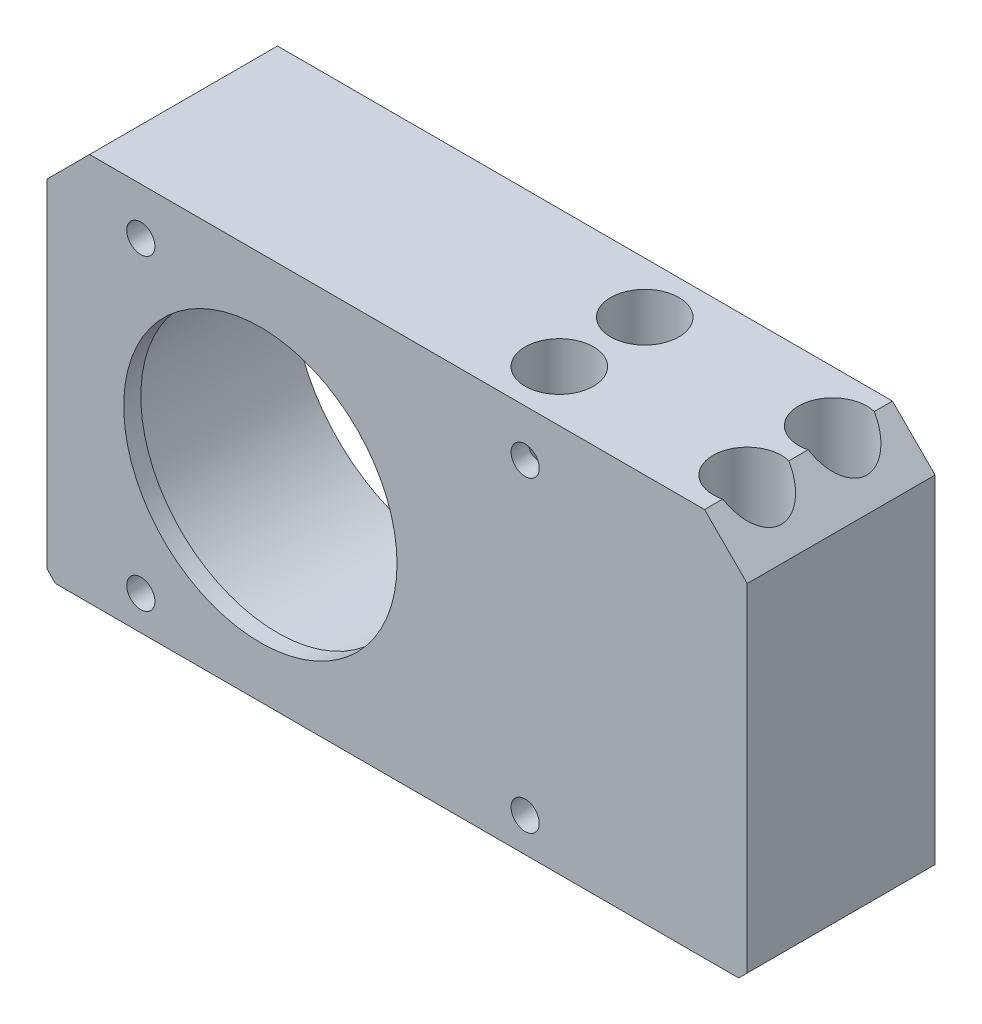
ISO-10303-21;
HEADER;
FILE_DESCRIPTION(('STEP AP214'),'2;1');
FILE_NAME('part.step','',(''),(''),'','','');
FILE_SCHEMA(('AUTOMOTIVE_DESIGN { 1 0 10303 214 1 1 1 1 }'));
ENDSEC;
DATA;
#1=APPLICATION_CONTEXT('core data for automotive mechanical design processes');
#2=APPLICATION_PROTOCOL_DEFINITION('international standard','automotive_design',2000,#1);
#3=PRODUCT_CONTEXT('',#1,'mechanical');
#4=PRODUCT('Part','Part','',(#3));
#5=PRODUCT_RELATED_PRODUCT_CATEGORY('part','',(#4));
#6=PRODUCT_DEFINITION_FORMATION('','',#4);
#7=PRODUCT_DEFINITION_CONTEXT('part definition',#1,'design');
#8=PRODUCT_DEFINITION('design','',#6,#7);
#9=PRODUCT_DEFINITION_SHAPE('','',#8);
#10=(LENGTH_UNIT() NAMED_UNIT(*) SI_UNIT(.MILLI.,.METRE.));
#11=(NAMED_UNIT(*) PLANE_ANGLE_UNIT() SI_UNIT($,.RADIAN.));
#12=(NAMED_UNIT(*) SI_UNIT($,.STERADIAN.) SOLID_ANGLE_UNIT());
#13=UNCERTAINTY_MEASURE_WITH_UNIT(LENGTH_MEASURE(1.E-05),#10,'distance_accuracy_value','');
#14=(GEOMETRIC_REPRESENTATION_CONTEXT(3) GLOBAL_UNCERTAINTY_ASSIGNED_CONTEXT((#13)) GLOBAL_UNIT_ASSIGNED_CONTEXT((#10,
#11,#12)) REPRESENTATION_CONTEXT('',''));
#15=CARTESIAN_POINT('',(0.,0.,0.));
#16=DIRECTION('',(0.,0.,1.));
#17=DIRECTION('',(1.,0.,0.));
#18=AXIS2_PLACEMENT_3D('',#15,#16,#17);
#19=CARTESIAN_POINT('',(12.5,48.2,-11.091420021));
#20=DIRECTION('',(0.,0.,1.));
#21=DIRECTION('',(0.,-1.,0.));
#22=AXIS2_PLACEMENT_3D('',#19,#20,#21);
#23=CONICAL_SURFACE('',#22,0.,1.02974425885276);
#24=CARTESIAN_POINT('',(12.5,48.2,-11.091420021));
#25=VERTEX_POINT('',#24);
#26=VERTEX_LOOP('',#25);
#27=FACE_BOUND('',#26,.T.);
#28=CARTESIAN_POINT('',(12.5,48.2,-10.1));
#29=DIRECTION('',(0.,0.,1.));
#30=DIRECTION('',(1.,0.,0.));
#31=AXIS2_PLACEMENT_3D('',#28,#29,#30);
#32=CIRCLE('',#31,1.65);
#33=CARTESIAN_POINT('',(14.15,48.2,-10.1));
#34=VERTEX_POINT('',#33);
#35=EDGE_CURVE('E160',#34,#34,#32,.F.);
#36=ORIENTED_EDGE('',*,*,#35,.F.);
#37=EDGE_LOOP('',(#36));
#38=FACE_BOUND('',#37,.T.);
#39=ADVANCED_FACE('F17',(#27,#38),#23,.F.);
#40=CARTESIAN_POINT('',(12.5,48.2,-10.1));
#41=DIRECTION('',(0.,0.,1.));
#42=DIRECTION('',(0.,-1.,0.));
#43=AXIS2_PLACEMENT_3D('',#40,#41,#42);
#44=CYLINDRICAL_SURFACE('',#43,1.65);
#45=ORIENTED_EDGE('',*,*,#35,.T.);
#46=EDGE_LOOP('',(#45));
#47=FACE_BOUND('',#46,.T.);
#48=CARTESIAN_POINT('',(10.8500000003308,48.2000000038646,-9.98465807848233));
#49=CARTESIAN_POINT('',(10.8500009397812,48.292008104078,-9.984658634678));
#50=CARTESIAN_POINT('',(10.8577155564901,48.3840256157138,-9.98400310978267));
#51=CARTESIAN_POINT('',(10.8883572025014,48.5654809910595,-9.98113188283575));
#52=CARTESIAN_POINT('',(10.9112869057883,48.6549183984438,-9.97891590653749));
#53=CARTESIAN_POINT('',(10.9716973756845,48.8286926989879,-9.97220594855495));
#54=CARTESIAN_POINT('',(11.0091838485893,48.9130275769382,-9.96771107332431));
#55=CARTESIAN_POINT('',(11.0975424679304,49.0740979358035,-9.95536641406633));
#56=CARTESIAN_POINT('',(11.1484130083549,49.150834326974,-9.94751703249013));
#57=CARTESIAN_POINT('',(11.26125497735,49.2937147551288,-9.92730593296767));
#58=CARTESIAN_POINT('',(11.3231085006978,49.3599583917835,-9.91499082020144));
#59=CARTESIAN_POINT('',(11.4560166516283,49.4808846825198,-9.88467030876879));
#60=CARTESIAN_POINT('',(11.5270687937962,49.5355704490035,-9.86666644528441));
#61=CARTESIAN_POINT('',(11.6739958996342,49.6309861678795,-9.82458296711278));
#62=CARTESIAN_POINT('',(11.7497287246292,49.6719990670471,-9.80064715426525));
#63=CARTESIAN_POINT('',(11.9045916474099,49.7411631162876,-9.74617889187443));
#64=CARTESIAN_POINT('',(11.9837218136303,49.7693140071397,-9.71564630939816));
#65=CARTESIAN_POINT('',(12.1440997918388,49.8133432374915,-9.64755505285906));
#66=CARTESIAN_POINT('',(12.2253602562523,49.8289947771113,-9.60988124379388));
#67=CARTESIAN_POINT('',(12.3862434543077,49.8480692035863,-9.52848822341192));
#68=CARTESIAN_POINT('',(12.4658654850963,49.8514869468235,-9.48476647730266));
#69=CARTESIAN_POINT('',(12.6304107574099,49.8471198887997,-9.38695978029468));
#70=CARTESIAN_POINT('',(12.7149322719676,49.8380407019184,-9.33226275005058));
#71=CARTESIAN_POINT('',(12.8781899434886,49.8082196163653,-9.21779284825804));
#72=CARTESIAN_POINT('',(12.9569239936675,49.787473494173,-9.15801814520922));
#73=CARTESIAN_POINT('',(13.1463141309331,49.7229158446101,-9.00310025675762));
#74=CARTESIAN_POINT('',(13.2528053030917,49.6727383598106,-8.9054487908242));
#75=CARTESIAN_POINT('',(13.4005475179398,49.5837778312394,-8.75532713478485));
#76=CARTESIAN_POINT('',(13.4478989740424,49.5517446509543,-8.70454774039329));
#77=CARTESIAN_POINT('',(13.538560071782,49.4833986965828,-8.60226939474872));
#78=CARTESIAN_POINT('',(13.5818712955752,49.4470876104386,-8.55077073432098));
#79=CARTESIAN_POINT('',(13.6652508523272,49.3696133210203,-8.4465752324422));
#80=CARTESIAN_POINT('',(13.7052386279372,49.3283687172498,-8.3938747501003));
#81=CARTESIAN_POINT('',(13.7809670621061,49.2416039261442,-8.28898076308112));
#82=CARTESIAN_POINT('',(13.8167095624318,49.1960856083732,-8.23678704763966));
#83=CARTESIAN_POINT('',(13.8837336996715,49.1006500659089,-8.13403211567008));
#84=CARTESIAN_POINT('',(13.915032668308,49.0507512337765,-8.08346518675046));
#85=CARTESIAN_POINT('',(13.973056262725,48.9457895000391,-7.98522390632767));
#86=CARTESIAN_POINT('',(13.9997880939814,48.8907349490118,-7.93754507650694));
#87=CARTESIAN_POINT('',(14.0414175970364,48.7904270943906,-7.86003534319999));
#88=CARTESIAN_POINT('',(14.0575417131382,48.7466866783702,-7.82892038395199));
#89=CARTESIAN_POINT('',(14.0866535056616,48.6553295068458,-7.77114554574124));
#90=CARTESIAN_POINT('',(14.0996441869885,48.6077165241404,-7.74448140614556));
#91=CARTESIAN_POINT('',(14.1194058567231,48.5188047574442,-7.70303126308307));
#92=CARTESIAN_POINT('',(14.1269110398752,48.4782971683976,-7.68692592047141));
#93=CARTESIAN_POINT('',(14.1389739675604,48.3949841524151,-7.6607471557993));
#94=CARTESIAN_POINT('',(14.1435408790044,48.3521863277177,-7.65065498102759));
#95=CARTESIAN_POINT('',(14.1475995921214,48.2907895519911,-7.64165289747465));
#96=CARTESIAN_POINT('',(14.1484971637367,48.2727052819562,-7.63965575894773));
#97=CARTESIAN_POINT('',(14.1496981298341,48.2364176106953,-7.63698054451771));
#98=CARTESIAN_POINT('',(14.1500014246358,48.2182141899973,-7.63630268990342));
#99=CARTESIAN_POINT('',(14.1499965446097,48.1558223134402,-7.63631682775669));
#100=CARTESIAN_POINT('',(14.148200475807,48.1115812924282,-7.64033882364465));
#101=CARTESIAN_POINT('',(14.1412405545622,48.0246426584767,-7.65572692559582));
#102=CARTESIAN_POINT('',(14.1360666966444,47.9819500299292,-7.66711484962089));
#103=CARTESIAN_POINT('',(14.1205139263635,47.8842827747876,-7.70068330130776));
#104=CARTESIAN_POINT('',(14.108937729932,47.8303464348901,-7.7252627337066));
#105=CARTESIAN_POINT('',(14.081711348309,47.7271818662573,-7.78109803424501));
#106=CARTESIAN_POINT('',(14.0660491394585,47.6779681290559,-7.81237355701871));
#107=CARTESIAN_POINT('',(14.0321632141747,47.5857724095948,-7.87752937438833));
#108=CARTESIAN_POINT('',(14.0140815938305,47.5426119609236,-7.91123577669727));
#109=CARTESIAN_POINT('',(13.9752218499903,47.4595093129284,-7.98101773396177));
#110=CARTESIAN_POINT('',(13.9544413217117,47.4195700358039,-8.01709538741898));
#111=CARTESIAN_POINT('',(13.9103472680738,47.3424475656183,-8.09078455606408));
#112=CARTESIAN_POINT('',(13.8870286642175,47.3052701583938,-8.12839904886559));
#113=CARTESIAN_POINT('',(13.8379934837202,47.2334791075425,-8.20450726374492));
#114=CARTESIAN_POINT('',(13.8122762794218,47.1988661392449,-8.24300121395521));
#115=CARTESIAN_POINT('',(13.7464765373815,47.1171106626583,-8.33774104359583));
#116=CARTESIAN_POINT('',(13.7051085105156,47.0712776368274,-8.39423584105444));
#117=CARTESIAN_POINT('',(13.6175290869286,46.9845050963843,-8.5072184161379));
#118=CARTESIAN_POINT('',(13.5713155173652,46.9435677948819,-8.56370617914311));
#119=CARTESIAN_POINT('',(13.4255244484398,46.8284182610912,-8.73188512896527));
#120=CARTESIAN_POINT('',(13.3185917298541,46.7616130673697,-8.84259528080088));
#121=CARTESIAN_POINT('',(13.1158857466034,46.6662862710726,-9.02835515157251));
#122=CARTESIAN_POINT('',(13.024321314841,46.6323369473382,-9.10525050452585));
#123=CARTESIAN_POINT('',(12.8317024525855,46.5806231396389,-9.2523460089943));
#124=CARTESIAN_POINT('',(12.7306631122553,46.5628333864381,-9.32255645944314));
#125=CARTESIAN_POINT('',(12.5402497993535,46.5482509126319,-9.44204191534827));
#126=CARTESIAN_POINT('',(12.4520643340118,46.5482465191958,-9.49280789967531));
#127=CARTESIAN_POINT('',(12.2730215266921,46.563224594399,-9.5870039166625));
#128=CARTESIAN_POINT('',(12.1821653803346,46.578200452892,-9.63043717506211));
#129=CARTESIAN_POINT('',(12.0004052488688,46.6246430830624,-9.70926612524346));
#130=CARTESIAN_POINT('',(11.9095043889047,46.6562104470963,-9.74461088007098));
#131=CARTESIAN_POINT('',(11.732281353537,46.7362566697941,-9.80661207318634));
#132=CARTESIAN_POINT('',(11.6459573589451,46.7847287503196,-9.83327198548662));
#133=CARTESIAN_POINT('',(11.4908132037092,46.8915816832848,-9.87609158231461));
#134=CARTESIAN_POINT('',(11.4211078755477,46.9483601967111,-9.89306650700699));
#135=CARTESIAN_POINT('',(11.2913289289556,47.0731834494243,-9.92150707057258));
#136=CARTESIAN_POINT('',(11.231254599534,47.1412273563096,-9.93297311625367));
#137=CARTESIAN_POINT('',(11.1240720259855,47.2850182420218,-9.95138422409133));
#138=CARTESIAN_POINT('',(11.0767079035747,47.3605631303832,-9.95842308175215));
#139=CARTESIAN_POINT('',(10.9947040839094,47.5184594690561,-9.96950706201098));
#140=CARTESIAN_POINT('',(10.9600635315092,47.6008104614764,-9.97355238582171));
#141=CARTESIAN_POINT('',(10.9050971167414,47.7682745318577,-9.97952860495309));
#142=CARTESIAN_POINT('',(10.8844820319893,47.8532913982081,-9.9815027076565));
#143=CARTESIAN_POINT('',(10.856932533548,48.0255359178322,-9.98406723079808));
#144=CARTESIAN_POINT('',(10.8499991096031,48.1127637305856,-9.98465755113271));
#145=CARTESIAN_POINT('',(10.8500000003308,48.2000000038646,-9.98465807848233));
#146=B_SPLINE_CURVE_WITH_KNOTS('',3,(#48,#49,#50,#51,#52,#53,#54,#55,#56,#57,#58,#59,#60,#61,
#62,#63,#64,#65,#66,#67,#68,#69,#70,#71,#72,#73,#74,#75,#76,#77,#78,#79,#80,#81,#82,#83,#84,#85,
#86,#87,#88,#89,#90,#91,#92,#93,#94,#95,#96,#97,#98,#99,#100,#101,#102,#103,#104,#105,#106,#107,
#108,#109,#110,#111,#112,#113,#114,#115,#116,#117,#118,#119,#120,#121,#122,#123,#124,#125,#126,
#127,#128,#129,#130,#131,#132,#133,#134,#135,#136,#137,#138,#139,#140,#141,#142,#143,#144,#145),
.UNSPECIFIED.,.T.,.F.,(4,2,2,2,2,2,2,2,2,2,2,2,2,2,2,2,2,2,2,2,2,2,2,2,2,2,2,2,2,2,2,2,2,2,2,2,
2,2,2,2,2,2,2,2,2,2,2,2,4),(0.,0.275717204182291,0.551482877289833,0.827356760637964,
1.10319755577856,1.37623878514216,1.64920639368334,1.91611224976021,2.18302348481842,
2.45467426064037,2.72643923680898,3.02856986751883,3.33080994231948,3.78698251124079,
4.01621684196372,4.24536102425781,4.47901303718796,4.71256330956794,4.94517601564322,
5.17741827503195,5.34528958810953,5.51299926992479,5.64527705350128,5.77714012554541,
5.831738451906,5.88634593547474,6.01879393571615,6.15163605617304,6.3317698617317,
6.51243983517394,6.68520312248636,6.85812141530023,7.03139229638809,7.20470864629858,
7.45544282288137,7.70628991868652,8.20666032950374,8.57827559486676,8.9493087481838,
9.25333724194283,9.55723164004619,9.86299013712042,10.1686261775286,10.4417531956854,
10.7148600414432,10.9819664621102,11.2490549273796,11.5104536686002,11.7718713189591),.UNSPECIFIED.);
#147=CARTESIAN_POINT('',(10.8500000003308,48.2000000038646,-9.98465807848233));
#148=VERTEX_POINT('',#147);
#149=EDGE_CURVE('E21',#148,#148,#146,.T.);
#150=ORIENTED_EDGE('',*,*,#149,.F.);
#151=EDGE_LOOP('',(#150));
#152=FACE_BOUND('',#151,.T.);
#153=ADVANCED_FACE('F282',(#47,#152),#44,.F.);
#154=CARTESIAN_POINT('',(-32.5,12.2,-11.091420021));
#155=DIRECTION('',(0.,0.,1.));
#156=DIRECTION('',(0.,-1.,0.));
#157=AXIS2_PLACEMENT_3D('',#154,#155,#156);
#158=CONICAL_SURFACE('',#157,0.,1.02974425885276);
#159=CARTESIAN_POINT('',(-32.5,12.2,-11.091420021));
#160=VERTEX_POINT('',#159);
#161=VERTEX_LOOP('',#160);
#162=FACE_BOUND('',#161,.T.);
#163=CARTESIAN_POINT('',(-32.5,12.2,-10.1));
#164=DIRECTION('',(0.,0.,1.));
#165=DIRECTION('',(1.,0.,0.));
#166=AXIS2_PLACEMENT_3D('',#163,#164,#165);
#167=CIRCLE('',#166,1.65);
#168=CARTESIAN_POINT('',(-30.85,12.2,-10.1));
#169=VERTEX_POINT('',#168);
#170=EDGE_CURVE('E149',#169,#169,#167,.F.);
#171=ORIENTED_EDGE('',*,*,#170,.F.);
#172=EDGE_LOOP('',(#171));
#173=FACE_BOUND('',#172,.T.);
#174=ADVANCED_FACE('F279',(#162,#173),#158,.F.);
#175=CARTESIAN_POINT('',(-32.5,48.2,-11.091420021));
#176=DIRECTION('',(0.,0.,1.));
#177=DIRECTION('',(0.,-1.,0.));
#178=AXIS2_PLACEMENT_3D('',#175,#176,#177);
#179=CONICAL_SURFACE('',#178,0.,1.02974425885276);
#180=CARTESIAN_POINT('',(-32.5,48.2,-11.091420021));
#181=VERTEX_POINT('',#180);
#182=VERTEX_LOOP('',#181);
#183=FACE_BOUND('',#182,.T.);
#184=CARTESIAN_POINT('',(-32.5,48.2,-10.1));
#185=DIRECTION('',(0.,0.,1.));
#186=DIRECTION('',(1.,0.,0.));
#187=AXIS2_PLACEMENT_3D('',#184,#185,#186);
#188=CIRCLE('',#187,1.65);
#189=CARTESIAN_POINT('',(-30.85,48.2,-10.1));
#190=VERTEX_POINT('',#189);
#191=EDGE_CURVE('E145',#190,#190,#188,.F.);
#192=ORIENTED_EDGE('',*,*,#191,.F.);
#193=EDGE_LOOP('',(#192));
#194=FACE_BOUND('',#193,.T.);
#195=ADVANCED_FACE('F276',(#183,#194),#179,.F.);
#196=CARTESIAN_POINT('',(-0.031,11.731,-2.));
#197=DIRECTION('',(0.,0.,-1.));
#198=DIRECTION('',(-1.,0.,0.));
#199=AXIS2_PLACEMENT_3D('',#196,#197,#198);
#200=PLANE('',#199);
#201=CARTESIAN_POINT('',(-18.5,30.2,-2.));
#202=DIRECTION('',(0.,0.,1.));
#203=DIRECTION('',(1.,0.,0.));
#204=AXIS2_PLACEMENT_3D('',#201,#202,#203);
#205=CIRCLE('',#204,16.);
#206=CARTESIAN_POINT('',(-2.5,30.2,-2.));
#207=VERTEX_POINT('',#206);
#208=EDGE_CURVE('E167',#207,#207,#205,.F.);
#209=ORIENTED_EDGE('',*,*,#208,.F.);
#210=EDGE_LOOP('',(#209));
#211=FACE_BOUND('',#210,.T.);
#212=CARTESIAN_POINT('',(-18.5,30.2,-2.));
#213=DIRECTION('',(0.,0.,-1.));
#214=DIRECTION('',(-1.,0.,0.));
#215=AXIS2_PLACEMENT_3D('',#212,#213,#214);
#216=CIRCLE('',#215,18.25);
#217=CARTESIAN_POINT('',(-36.75,30.2,-2.));
#218=VERTEX_POINT('',#217);
#219=EDGE_CURVE('E125',#218,#218,#216,.F.);
#220=ORIENTED_EDGE('',*,*,#219,.F.);
#221=EDGE_LOOP('',(#220));
#222=FACE_BOUND('',#221,.T.);
#223=ADVANCED_FACE('F274',(#211,#222),#200,.T.);
#224=CARTESIAN_POINT('',(12.5,12.2,-11.091420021));
#225=DIRECTION('',(0.,0.,1.));
#226=DIRECTION('',(0.,-1.,0.));
#227=AXIS2_PLACEMENT_3D('',#224,#225,#226);
#228=CONICAL_SURFACE('',#227,0.,1.02974425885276);
#229=CARTESIAN_POINT('',(12.5,12.2,-11.091420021));
#230=VERTEX_POINT('',#229);
#231=VERTEX_LOOP('',#230);
#232=FACE_BOUND('',#231,.T.);
#233=CARTESIAN_POINT('',(12.5,12.2,-10.1));
#234=DIRECTION('',(0.,0.,1.));
#235=DIRECTION('',(1.,0.,0.));
#236=AXIS2_PLACEMENT_3D('',#233,#234,#235);
#237=CIRCLE('',#236,1.65);
#238=CARTESIAN_POINT('',(14.15,12.2,-10.1));
#239=VERTEX_POINT('',#238);
#240=EDGE_CURVE('E140',#239,#239,#237,.F.);
#241=ORIENTED_EDGE('',*,*,#240,.F.);
#242=EDGE_LOOP('',(#241));
#243=FACE_BOUND('',#242,.T.);
#244=ADVANCED_FACE('F268',(#232,#243),#228,.F.);
#245=CARTESIAN_POINT('',(10.5,18.7,-6.));
#246=DIRECTION('',(0.,1.,0.));
#247=DIRECTION('',(0.,0.,1.));
#248=AXIS2_PLACEMENT_3D('',#245,#246,#247);
#249=CYLINDRICAL_SURFACE('',#248,4.);
#250=CARTESIAN_POINT('',(10.5,18.7,-6.));
#251=DIRECTION('',(0.,1.,0.));
#252=DIRECTION('',(0.,0.,1.));
#253=AXIS2_PLACEMENT_3D('',#250,#251,#252);
#254=CIRCLE('',#253,4.);
#255=CARTESIAN_POINT('',(10.5,18.7,-2.));
#256=VERTEX_POINT('',#255);
#257=EDGE_CURVE('E143',#256,#256,#254,.F.);
#258=ORIENTED_EDGE('',*,*,#257,.T.);
#259=EDGE_LOOP('',(#258));
#260=FACE_BOUND('',#259,.T.);
#261=CARTESIAN_POINT('',(10.5,53.7,-6.));
#262=DIRECTION('',(0.,1.,0.));
#263=DIRECTION('',(0.,0.,1.));
#264=AXIS2_PLACEMENT_3D('',#261,#262,#263);
#265=CIRCLE('',#264,4.);
#266=CARTESIAN_POINT('',(10.5,53.7,-2.));
#267=VERTEX_POINT('',#266);
#268=EDGE_CURVE('E436',#267,#267,#265,.F.);
#269=ORIENTED_EDGE('',*,*,#268,.F.);
#270=EDGE_LOOP('',(#269));
#271=FACE_BOUND('',#270,.T.);
#272=ORIENTED_EDGE('',*,*,#149,.T.);
#273=EDGE_LOOP('',(#272));
#274=FACE_BOUND('',#273,.T.);
#275=CARTESIAN_POINT('',(14.1500000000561,48.1999999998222,-4.36369318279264));
#276=CARTESIAN_POINT('',(14.1499965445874,48.1558223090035,-4.36368317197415));
#277=CARTESIAN_POINT('',(14.1482004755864,48.1115812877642,-4.35966117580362));
#278=CARTESIAN_POINT('',(14.1412405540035,48.0246426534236,-4.34427307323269));
#279=CARTESIAN_POINT('',(14.1360666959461,47.9819500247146,-4.33288514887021));
#280=CARTESIAN_POINT('',(14.1205139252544,47.8842827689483,-4.29931669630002));
#281=CARTESIAN_POINT('',(14.1089377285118,47.8303464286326,-4.27473726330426));
#282=CARTESIAN_POINT('',(14.0817113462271,47.7271818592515,-4.21890196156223));
#283=CARTESIAN_POINT('',(14.0660491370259,47.6779681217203,-4.18762643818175));
#284=CARTESIAN_POINT('',(14.0321632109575,47.5857724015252,-4.12247061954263));
#285=CARTESIAN_POINT('',(14.0140815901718,47.5426119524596,-4.08876421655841));
#286=CARTESIAN_POINT('',(13.975221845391,47.4595093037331,-4.0189822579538));
#287=CARTESIAN_POINT('',(13.9544413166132,47.4195700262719,-3.98290460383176));
#288=CARTESIAN_POINT('',(13.9103472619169,47.3424475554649,-3.90921543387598));
#289=CARTESIAN_POINT('',(13.8870286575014,47.3052701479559,-3.8716009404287));
#290=CARTESIAN_POINT('',(13.8379934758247,47.2334790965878,-3.79549272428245));
#291=CARTESIAN_POINT('',(13.8122762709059,47.198866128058,-3.75699877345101));
#292=CARTESIAN_POINT('',(13.746476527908,47.117110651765,-3.66225894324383));
#293=CARTESIAN_POINT('',(13.7051085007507,47.0712776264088,-3.60576414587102));
#294=CARTESIAN_POINT('',(13.617529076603,46.9845050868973,-3.49278157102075));
#295=CARTESIAN_POINT('',(13.5713155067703,46.9435677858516,-3.43629380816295));
#296=CARTESIAN_POINT('',(13.4255244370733,46.8284182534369,-3.26811485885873));
#297=CARTESIAN_POINT('',(13.3185917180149,46.761613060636,-3.15740470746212));
#298=CARTESIAN_POINT('',(13.1158857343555,46.6662862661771,-2.97164483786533));
#299=CARTESIAN_POINT('',(13.0243213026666,46.6323369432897,-2.8947494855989));
#300=CARTESIAN_POINT('',(12.8317024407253,46.5806231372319,-2.74765398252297));
#301=CARTESIAN_POINT('',(12.7306631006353,46.5628333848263,-2.67744353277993));
#302=CARTESIAN_POINT('',(12.5402497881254,46.5482509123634,-2.55795807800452));
#303=CARTESIAN_POINT('',(12.452064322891,46.5482465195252,-2.50719209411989));
#304=CARTESIAN_POINT('',(12.2730215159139,46.5632245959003,-2.41299607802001));
#305=CARTESIAN_POINT('',(12.1821653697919,46.5782004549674,-2.36956282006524));
#306=CARTESIAN_POINT('',(12.0004052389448,46.6246430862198,-2.29073387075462));
#307=CARTESIAN_POINT('',(11.9095043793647,46.6562104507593,-2.25538911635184));
#308=CARTESIAN_POINT('',(11.7322813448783,46.7362566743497,-2.19338792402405));
#309=CARTESIAN_POINT('',(11.6459573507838,46.7847287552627,-2.1667280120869));
#310=CARTESIAN_POINT('',(11.4908131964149,46.8915816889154,-2.12390841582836));
#311=CARTESIAN_POINT('',(11.4211078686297,46.9483602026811,-2.10693349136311));
#312=CARTESIAN_POINT('',(11.2913289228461,47.0731834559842,-2.07849292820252));
#313=CARTESIAN_POINT('',(11.2312545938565,47.1412273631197,-2.06702688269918));
#314=CARTESIAN_POINT('',(11.1240720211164,47.2850182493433,-2.04861577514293));
#315=CARTESIAN_POINT('',(11.0767078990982,47.3605631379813,-2.04157691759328));
#316=CARTESIAN_POINT('',(10.9947040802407,47.5184594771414,-2.03049293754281));
#317=CARTESIAN_POINT('',(10.960063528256,47.6008104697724,-2.02644761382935));
#318=CARTESIAN_POINT('',(10.905097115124,47.7682745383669,-2.02047139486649));
#319=CARTESIAN_POINT('',(10.884482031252,47.8532914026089,-2.01849729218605));
#320=CARTESIAN_POINT('',(10.8569325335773,48.0255359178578,-2.01593276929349));
#321=CARTESIAN_POINT('',(10.8499991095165,48.1127637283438,-2.01534244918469));
#322=CARTESIAN_POINT('',(10.850000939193,48.2920080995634,-2.01534136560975));
#323=CARTESIAN_POINT('',(10.8577155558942,48.3840256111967,-2.01599689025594));
#324=CARTESIAN_POINT('',(10.8883572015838,48.5654809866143,-2.01886811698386));
#325=CARTESIAN_POINT('',(10.9112869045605,48.6549183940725,-2.02108409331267));
#326=CARTESIAN_POINT('',(10.9716973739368,48.8286926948,-2.02779405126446));
#327=CARTESIAN_POINT('',(11.0091838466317,48.9130275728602,-2.03228892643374));
#328=CARTESIAN_POINT('',(11.0975424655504,49.0740979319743,-2.04463358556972));
#329=CARTESIAN_POINT('',(11.1484130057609,49.1508343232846,-2.0524829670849));
#330=CARTESIAN_POINT('',(11.2612549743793,49.293714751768,-2.07269406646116));
#331=CARTESIAN_POINT('',(11.3231084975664,49.3599583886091,-2.08500917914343));
#332=CARTESIAN_POINT('',(11.4560166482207,49.4808846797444,-2.11532969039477));
#333=CARTESIAN_POINT('',(11.5270687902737,49.5355704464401,-2.13333355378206));
#334=CARTESIAN_POINT('',(11.6739958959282,49.6309861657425,-2.17541703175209));
#335=CARTESIAN_POINT('',(11.7497287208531,49.6719990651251,-2.1993528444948));
#336=CARTESIAN_POINT('',(11.9045916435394,49.7411631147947,-2.25382110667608));
#337=CARTESIAN_POINT('',(11.9837218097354,49.769314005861,-2.28435368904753));
#338=CARTESIAN_POINT('',(12.1440997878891,49.8133432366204,-2.35244494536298));
#339=CARTESIAN_POINT('',(12.2253602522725,49.8289947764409,-2.39011875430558));
#340=CARTESIAN_POINT('',(12.3862434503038,49.8480692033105,-2.47151177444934));
#341=CARTESIAN_POINT('',(12.4658654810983,49.8514869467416,-2.51523352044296));
#342=CARTESIAN_POINT('',(12.6304107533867,49.8471198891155,-2.61304021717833));
#343=CARTESIAN_POINT('',(12.7149322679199,49.8380407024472,-2.66773724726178));
#344=CARTESIAN_POINT('',(12.8781899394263,49.8082196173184,-2.78220714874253));
#345=CARTESIAN_POINT('',(12.956923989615,49.7874734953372,-2.84198185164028));
#346=CARTESIAN_POINT('',(13.1463141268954,49.7229158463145,-2.99689973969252));
#347=CARTESIAN_POINT('',(13.2528052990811,49.6727383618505,-3.09455120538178));
#348=CARTESIAN_POINT('',(13.400547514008,49.5837778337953,-3.24467286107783));
#349=CARTESIAN_POINT('',(13.4478989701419,49.5517446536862,-3.29545225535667));
#350=CARTESIAN_POINT('',(13.5385600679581,49.4833986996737,-3.39773060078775));
#351=CARTESIAN_POINT('',(13.5818712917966,49.4470876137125,-3.44922926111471));
#352=CARTESIAN_POINT('',(13.6652508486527,49.3696133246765,-3.55342476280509));
#353=CARTESIAN_POINT('',(13.7052386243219,49.3283687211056,-3.60612524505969));
#354=CARTESIAN_POINT('',(13.7809670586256,49.2416039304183,-3.71101923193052));
#355=CARTESIAN_POINT('',(13.8167095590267,49.196085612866,-3.76321294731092));
#356=CARTESIAN_POINT('',(13.8837336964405,49.1006500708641,-3.86596787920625));
#357=CARTESIAN_POINT('',(13.915032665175,49.0507512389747,-3.91653480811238));
#358=CARTESIAN_POINT('',(13.9730562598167,48.9457895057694,-4.01477608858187));
#359=CARTESIAN_POINT('',(13.9997880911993,48.8907349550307,-4.06245491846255));
#360=CARTESIAN_POINT('',(14.0414175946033,48.7904271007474,-4.13996465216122));
#361=CARTESIAN_POINT('',(14.0575417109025,48.7466866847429,-4.17107961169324));
#362=CARTESIAN_POINT('',(14.0866535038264,48.6553295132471,-4.22885445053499));
#363=CARTESIAN_POINT('',(14.0996441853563,48.6077165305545,-4.25551859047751));
#364=CARTESIAN_POINT('',(14.1194058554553,48.518804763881,-4.29696873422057));
#365=CARTESIAN_POINT('',(14.126911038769,48.4782971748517,-4.31307407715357));
#366=CARTESIAN_POINT('',(14.1389739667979,48.3949841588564,-4.33925284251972));
#367=CARTESIAN_POINT('',(14.1435408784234,48.3521863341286,-4.3493450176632));
#368=CARTESIAN_POINT('',(14.1475995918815,48.2907895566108,-4.35834710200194));
#369=CARTESIAN_POINT('',(14.1484971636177,48.2727052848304,-4.36034424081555));
#370=CARTESIAN_POINT('',(14.1496981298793,48.2364176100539,-4.36301945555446));
#371=CARTESIAN_POINT('',(14.1500014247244,48.218214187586,-4.36369731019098));
#372=CARTESIAN_POINT('',(14.1500000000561,48.1999999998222,-4.36369318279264));
#373=B_SPLINE_CURVE_WITH_KNOTS('',3,(#275,#276,#277,#278,#279,#280,#281,#282,#283,#284,#285,
#286,#287,#288,#289,#290,#291,#292,#293,#294,#295,#296,#297,#298,#299,#300,#301,#302,#303,#304,
#305,#306,#307,#308,#309,#310,#311,#312,#313,#314,#315,#316,#317,#318,#319,#320,#321,#322,#323,
#324,#325,#326,#327,#328,#329,#330,#331,#332,#333,#334,#335,#336,#337,#338,#339,#340,#341,#342,
#343,#344,#345,#346,#347,#348,#349,#350,#351,#352,#353,#354,#355,#356,#357,#358,#359,#360,#361,
#362,#363,#364,#365,#366,#367,#368,#369,#370,#371,#372),.UNSPECIFIED.,.T.,.F.,(4,2,2,2,2,2,2,2,
2,2,2,2,2,2,2,2,2,2,2,2,2,2,2,2,2,2,2,2,2,2,2,2,2,2,2,2,2,2,2,2,2,2,2,2,2,2,2,2,4),(0.,
0.132448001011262,0.265290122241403,0.445423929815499,0.626093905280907,0.798857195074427,
0.971775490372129,1.14504637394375,1.31836272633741,1.56909690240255,1.81994399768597,
2.3203144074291,2.69192967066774,3.06296282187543,3.3669913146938,3.67088571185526,
3.97664420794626,4.28228024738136,4.55540726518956,4.8285141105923,5.09562053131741,
5.36270899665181,5.62410773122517,5.88552537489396,6.16124257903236,6.43700825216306,
6.71288213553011,6.98872293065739,7.26176416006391,7.53473176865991,7.80163762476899,
8.06854885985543,8.34019963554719,8.61196461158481,8.91409524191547,9.21633531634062,
9.6725078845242,9.90174221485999,10.1308863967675,10.3645384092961,10.5980886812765,
10.8307013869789,11.0629436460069,11.2308149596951,11.3985246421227,11.5308024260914,
11.6626654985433,11.7172638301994,11.7718713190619),.UNSPECIFIED.);
#374=CARTESIAN_POINT('',(14.1500000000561,48.1999999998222,-4.36369318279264));
#375=VERTEX_POINT('',#374);
#376=EDGE_CURVE('E148',#375,#375,#373,.T.);
#377=ORIENTED_EDGE('',*,*,#376,.F.);
#378=EDGE_LOOP('',(#377));
#379=FACE_BOUND('',#378,.T.);
#380=ADVANCED_FACE('F262',(#260,#271,#274,#379),#249,.F.);
#381=CARTESIAN_POINT('',(10.5,18.7,-16.));
#382=DIRECTION('',(0.,1.,0.));
#383=DIRECTION('',(0.,0.,1.));
#384=AXIS2_PLACEMENT_3D('',#381,#382,#383);
#385=CYLINDRICAL_SURFACE('',#384,4.);
#386=CARTESIAN_POINT('',(10.5,18.7,-16.));
#387=DIRECTION('',(0.,1.,0.));
#388=DIRECTION('',(0.,0.,1.));
#389=AXIS2_PLACEMENT_3D('',#386,#387,#388);
#390=CIRCLE('',#389,4.);
#391=CARTESIAN_POINT('',(10.5,18.7,-12.));
#392=VERTEX_POINT('',#391);
#393=EDGE_CURVE('E427',#392,#392,#390,.F.);
#394=ORIENTED_EDGE('',*,*,#393,.T.);
#395=EDGE_LOOP('',(#394));
#396=FACE_BOUND('',#395,.T.);
#397=CARTESIAN_POINT('',(10.5,53.7,-16.));
#398=DIRECTION('',(0.,1.,0.));
#399=DIRECTION('',(0.,0.,1.));
#400=AXIS2_PLACEMENT_3D('',#397,#398,#399);
#401=CIRCLE('',#400,4.);
#402=CARTESIAN_POINT('',(10.5,53.7,-12.));
#403=VERTEX_POINT('',#402);
#404=EDGE_CURVE('E165',#403,#403,#401,.F.);
#405=ORIENTED_EDGE('',*,*,#404,.F.);
#406=EDGE_LOOP('',(#405));
#407=FACE_BOUND('',#406,.T.);
#408=ADVANCED_FACE('F267',(#396,#407),#385,.F.);
#409=CARTESIAN_POINT('',(32.5,18.7,-6.));
#410=DIRECTION('',(0.,1.,0.));
#411=DIRECTION('',(0.,0.,1.));
#412=AXIS2_PLACEMENT_3D('',#409,#410,#411);
#413=CYLINDRICAL_SURFACE('',#412,4.);
#414=CARTESIAN_POINT('',(32.5,18.7,-6.));
#415=DIRECTION('',(0.,1.,0.));
#416=DIRECTION('',(0.,0.,1.));
#417=AXIS2_PLACEMENT_3D('',#414,#415,#416);
#418=CIRCLE('',#417,4.);
#419=CARTESIAN_POINT('',(32.5,18.7,-2.));
#420=VERTEX_POINT('',#419);
#421=EDGE_CURVE('E424',#420,#420,#418,.F.);
#422=ORIENTED_EDGE('',*,*,#421,.T.);
#423=EDGE_LOOP('',(#422));
#424=FACE_BOUND('',#423,.T.);
#425=CARTESIAN_POINT('',(32.5,54.7,-6.));
#426=DIRECTION('',(-0.707106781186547,-0.707106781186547,0.));
#427=DIRECTION('',(-0.707106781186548,0.707106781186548,0.));
#428=AXIS2_PLACEMENT_3D('',#425,#426,#427);
#429=ELLIPSE('',#428,5.65685424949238,4.);
#430=CARTESIAN_POINT('',(33.5,53.7,-2.12701665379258));
#431=VERTEX_POINT('',#430);
#432=CARTESIAN_POINT('',(33.5,53.7,-9.87298334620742));
#433=VERTEX_POINT('',#432);
#434=EDGE_CURVE('E139',#431,#433,#429,.F.);
#435=ORIENTED_EDGE('',*,*,#434,.T.);
#436=CARTESIAN_POINT('',(32.5,53.7,-6.));
#437=DIRECTION('',(0.,1.,0.));
#438=DIRECTION('',(0.,0.,1.));
#439=AXIS2_PLACEMENT_3D('',#436,#437,#438);
#440=CIRCLE('',#439,4.);
#441=EDGE_CURVE('E134',#431,#433,#440,.F.);
#442=ORIENTED_EDGE('',*,*,#441,.F.);
#443=EDGE_LOOP('',(#435,#442));
#444=FACE_BOUND('',#443,.T.);
#445=ADVANCED_FACE('F454',(#424,#444),#413,.F.);
#446=CARTESIAN_POINT('',(32.5,18.7,-16.));
#447=DIRECTION('',(0.,1.,0.));
#448=DIRECTION('',(0.,0.,1.));
#449=AXIS2_PLACEMENT_3D('',#446,#447,#448);
#450=CYLINDRICAL_SURFACE('',#449,4.);
#451=CARTESIAN_POINT('',(32.5,18.7,-16.));
#452=DIRECTION('',(0.,1.,0.));
#453=DIRECTION('',(0.,0.,1.));
#454=AXIS2_PLACEMENT_3D('',#451,#452,#453);
#455=CIRCLE('',#454,4.);
#456=CARTESIAN_POINT('',(32.5,18.7,-12.));
#457=VERTEX_POINT('',#456);
#458=EDGE_CURVE('E421',#457,#457,#455,.F.);
#459=ORIENTED_EDGE('',*,*,#458,.T.);
#460=EDGE_LOOP('',(#459));
#461=FACE_BOUND('',#460,.T.);
#462=CARTESIAN_POINT('',(32.5,54.7,-16.));
#463=DIRECTION('',(-0.707106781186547,-0.707106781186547,0.));
#464=DIRECTION('',(-0.707106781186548,0.707106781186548,0.));
#465=AXIS2_PLACEMENT_3D('',#462,#463,#464);
#466=ELLIPSE('',#465,5.65685424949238,4.);
#467=CARTESIAN_POINT('',(33.5,53.7,-12.1270166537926));
#468=VERTEX_POINT('',#467);
#469=CARTESIAN_POINT('',(33.5,53.7,-19.8729833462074));
#470=VERTEX_POINT('',#469);
#471=EDGE_CURVE('E121',#468,#470,#466,.F.);
#472=ORIENTED_EDGE('',*,*,#471,.T.);
#473=CARTESIAN_POINT('',(32.5,53.7,-16.));
#474=DIRECTION('',(0.,1.,0.));
#475=DIRECTION('',(0.,0.,1.));
#476=AXIS2_PLACEMENT_3D('',#473,#474,#475);
#477=CIRCLE('',#476,4.);
#478=EDGE_CURVE('E108',#468,#470,#477,.F.);
#479=ORIENTED_EDGE('',*,*,#478,.F.);
#480=EDGE_LOOP('',(#472,#479));
#481=FACE_BOUND('',#480,.T.);
#482=ADVANCED_FACE('F122',(#461,#481),#450,.F.);
#483=CARTESIAN_POINT('',(-18.5,30.2,-2.));
#484=DIRECTION('',(0.,0.,-1.));
#485=DIRECTION('',(-1.,0.,0.));
#486=AXIS2_PLACEMENT_3D('',#483,#484,#485);
#487=CYLINDRICAL_SURFACE('',#486,18.25);
#488=ORIENTED_EDGE('',*,*,#219,.T.);
#489=EDGE_LOOP('',(#488));
#490=FACE_BOUND('',#489,.T.);
#491=CARTESIAN_POINT('',(-18.5,30.2,-22.));
#492=DIRECTION('',(0.,0.,-1.));
#493=DIRECTION('',(-1.,0.,0.));
#494=AXIS2_PLACEMENT_3D('',#491,#492,#493);
#495=CIRCLE('',#494,18.25);
#496=CARTESIAN_POINT('',(-36.75,30.2,-22.));
#497=VERTEX_POINT('',#496);
#498=EDGE_CURVE('E176',#497,#497,#495,.T.);
#499=ORIENTED_EDGE('',*,*,#498,.T.);
#500=EDGE_LOOP('',(#499));
#501=FACE_BOUND('',#500,.T.);
#502=ADVANCED_FACE('F297',(#490,#501),#487,.F.);
#503=CARTESIAN_POINT('',(38.5,9.2,-22.));
#504=DIRECTION('',(1.,0.,0.));
#505=DIRECTION('',(0.,1.,0.));
#506=AXIS2_PLACEMENT_3D('',#503,#504,#505);
#507=PLANE('',#506);
#508=DIRECTION('',(0.,1.,0.));
#509=VECTOR('',#508,1.);
#510=CARTESIAN_POINT('',(38.5,30.95,-22.));
#511=LINE('',#510,#509);
#512=CARTESIAN_POINT('',(38.5,9.20000000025,-22.));
#513=VERTEX_POINT('',#512);
#514=CARTESIAN_POINT('',(38.5,48.7,-22.));
#515=VERTEX_POINT('',#514);
#516=EDGE_CURVE('E171',#513,#515,#511,.T.);
#517=ORIENTED_EDGE('',*,*,#516,.T.);
#518=DIRECTION('',(0.,0.,1.));
#519=VECTOR('',#518,1.);
#520=CARTESIAN_POINT('',(38.5,48.7,-11.));
#521=LINE('',#520,#519);
#522=CARTESIAN_POINT('',(38.5,48.6999999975,0.));
#523=VERTEX_POINT('',#522);
#524=EDGE_CURVE('E124',#515,#523,#521,.T.);
#525=ORIENTED_EDGE('',*,*,#524,.T.);
#526=DIRECTION('',(0.,1.,0.));
#527=VECTOR('',#526,1.);
#528=CARTESIAN_POINT('',(38.5,30.95,0.));
#529=LINE('',#528,#527);
#530=CARTESIAN_POINT('',(38.5,9.2000000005,0.));
#531=VERTEX_POINT('',#530);
#532=EDGE_CURVE('E186',#531,#523,#529,.T.);
#533=ORIENTED_EDGE('',*,*,#532,.F.);
#534=DIRECTION('',(0.,0.,-1.));
#535=VECTOR('',#534,1.);
#536=CARTESIAN_POINT('',(38.5,9.2,-11.));
#537=LINE('',#536,#535);
#538=EDGE_CURVE('E182',#531,#513,#537,.T.);
#539=ORIENTED_EDGE('',*,*,#538,.T.);
#540=EDGE_LOOP('',(#517,#525,#533,#539));
#541=FACE_BOUND('',#540,.T.);
#542=ADVANCED_FACE('F294',(#541),#507,.T.);
#543=CARTESIAN_POINT('',(38.5,48.7,-22.));
#544=DIRECTION('',(-0.707106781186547,-0.707106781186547,0.));
#545=DIRECTION('',(0.,0.,1.));
#546=AXIS2_PLACEMENT_3D('',#543,#544,#545);
#547=PLANE('',#546);
#548=DIRECTION('',(0.,0.,-1.));
#549=VECTOR('',#548,1.);
#550=CARTESIAN_POINT('',(33.5,53.7,-11.));
#551=LINE('',#550,#549);
#552=CARTESIAN_POINT('',(33.49999999,53.7,0.));
#553=VERTEX_POINT('',#552);
#554=EDGE_CURVE('E132',#553,#431,#551,.T.);
#555=ORIENTED_EDGE('',*,*,#554,.F.);
#556=DIRECTION('',(-0.707106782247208,0.707106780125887,0.));
#557=VECTOR('',#556,1.);
#558=CARTESIAN_POINT('',(38.5,48.699999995,0.));
#559=LINE('',#558,#557);
#560=EDGE_CURVE('E156',#523,#553,#559,.T.);
#561=ORIENTED_EDGE('',*,*,#560,.F.);
#562=ORIENTED_EDGE('',*,*,#524,.F.);
#563=DIRECTION('',(-0.707106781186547,0.707106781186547,0.));
#564=VECTOR('',#563,1.);
#565=CARTESIAN_POINT('',(38.5,48.7,-22.));
#566=LINE('',#565,#564);
#567=CARTESIAN_POINT('',(33.5,53.7,-22.));
#568=VERTEX_POINT('',#567);
#569=EDGE_CURVE('E131',#515,#568,#566,.T.);
#570=ORIENTED_EDGE('',*,*,#569,.T.);
#571=DIRECTION('',(0.,0.,-1.));
#572=VECTOR('',#571,1.);
#573=CARTESIAN_POINT('',(33.5,53.7,-11.));
#574=LINE('',#573,#572);
#575=EDGE_CURVE('E116',#470,#568,#574,.T.);
#576=ORIENTED_EDGE('',*,*,#575,.F.);
#577=ORIENTED_EDGE('',*,*,#471,.F.);
#578=DIRECTION('',(0.,0.,-1.));
#579=VECTOR('',#578,1.);
#580=CARTESIAN_POINT('',(33.5,53.7,-11.));
#581=LINE('',#580,#579);
#582=EDGE_CURVE('E119',#433,#468,#581,.T.);
#583=ORIENTED_EDGE('',*,*,#582,.F.);
#584=ORIENTED_EDGE('',*,*,#434,.F.);
#585=EDGE_LOOP('',(#555,#561,#562,#570,#576,#577,#583,#584));
#586=FACE_BOUND('',#585,.T.);
#587=ADVANCED_FACE('F129',(#586),#547,.F.);
#588=CARTESIAN_POINT('',(33.5,53.7,-22.));
#589=DIRECTION('',(0.,1.,0.));
#590=DIRECTION('',(-1.,0.,0.));
#591=AXIS2_PLACEMENT_3D('',#588,#589,#590);
#592=PLANE('',#591);
#593=ORIENTED_EDGE('',*,*,#404,.T.);
#594=EDGE_LOOP('',(#593));
#595=FACE_BOUND('',#594,.T.);
#596=ORIENTED_EDGE('',*,*,#268,.T.);
#597=EDGE_LOOP('',(#596));
#598=FACE_BOUND('',#597,.T.);
#599=ORIENTED_EDGE('',*,*,#554,.T.);
#600=ORIENTED_EDGE('',*,*,#441,.T.);
#601=ORIENTED_EDGE('',*,*,#582,.T.);
#602=ORIENTED_EDGE('',*,*,#478,.T.);
#603=ORIENTED_EDGE('',*,*,#575,.T.);
#604=DIRECTION('',(-1.,0.,0.));
#605=VECTOR('',#604,1.);
#606=CARTESIAN_POINT('',(-2.5,53.7,-22.));
#607=LINE('',#606,#605);
#608=CARTESIAN_POINT('',(-38.5,53.7,-22.));
#609=VERTEX_POINT('',#608);
#610=EDGE_CURVE('E157',#568,#609,#607,.T.);
#611=ORIENTED_EDGE('',*,*,#610,.T.);
#612=DIRECTION('',(0.,0.,1.));
#613=VECTOR('',#612,1.);
#614=CARTESIAN_POINT('',(-38.5,53.7,-11.));
#615=LINE('',#614,#613);
#616=CARTESIAN_POINT('',(-38.49999999,53.7,0.));
#617=VERTEX_POINT('',#616);
#618=EDGE_CURVE('E152',#609,#617,#615,.T.);
#619=ORIENTED_EDGE('',*,*,#618,.T.);
#620=DIRECTION('',(-1.,0.,0.));
#621=VECTOR('',#620,1.);
#622=CARTESIAN_POINT('',(-2.5,53.7,0.));
#623=LINE('',#622,#621);
#624=EDGE_CURVE('E153',#553,#617,#623,.T.);
#625=ORIENTED_EDGE('',*,*,#624,.F.);
#626=EDGE_LOOP('',(#599,#600,#601,#602,#603,#611,#619,#625));
#627=FACE_BOUND('',#626,.T.);
#628=ADVANCED_FACE('F113',(#595,#598,#627),#592,.T.);
#629=CARTESIAN_POINT('',(-38.5,53.7,-22.));
#630=DIRECTION('',(0.707106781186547,-0.707106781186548,0.));
#631=DIRECTION('',(0.,0.,1.));
#632=AXIS2_PLACEMENT_3D('',#629,#630,#631);
#633=PLANE('',#632);
#634=DIRECTION('',(0.,0.,-1.));
#635=VECTOR('',#634,1.);
#636=CARTESIAN_POINT('',(-43.5,48.7,-11.));
#637=LINE('',#636,#635);
#638=CARTESIAN_POINT('',(-43.5,48.6999999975,0.));
#639=VERTEX_POINT('',#638);
#640=CARTESIAN_POINT('',(-43.5,48.7,-22.));
#641=VERTEX_POINT('',#640);
#642=EDGE_CURVE('E144',#639,#641,#637,.T.);
#643=ORIENTED_EDGE('',*,*,#642,.F.);
#644=DIRECTION('',(-0.707106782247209,-0.707106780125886,0.));
#645=VECTOR('',#644,1.);
#646=CARTESIAN_POINT('',(-38.49999998,53.7,0.));
#647=LINE('',#646,#645);
#648=EDGE_CURVE('E155',#617,#639,#647,.T.);
#649=ORIENTED_EDGE('',*,*,#648,.F.);
#650=ORIENTED_EDGE('',*,*,#618,.F.);
#651=DIRECTION('',(-0.707106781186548,-0.707106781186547,0.));
#652=VECTOR('',#651,1.);
#653=CARTESIAN_POINT('',(-38.5,53.7,-22.));
#654=LINE('',#653,#652);
#655=EDGE_CURVE('E159',#609,#641,#654,.T.);
#656=ORIENTED_EDGE('',*,*,#655,.T.);
#657=EDGE_LOOP('',(#643,#649,#650,#656));
#658=FACE_BOUND('',#657,.T.);
#659=ADVANCED_FACE('F303',(#658),#633,.F.);
#660=CARTESIAN_POINT('',(-32.5,12.2,-10.1));
#661=DIRECTION('',(0.,0.,1.));
#662=DIRECTION('',(0.,-1.,0.));
#663=AXIS2_PLACEMENT_3D('',#660,#661,#662);
#664=CYLINDRICAL_SURFACE('',#663,1.65);
#665=CARTESIAN_POINT('',(-32.5,12.2,0.));
#666=DIRECTION('',(0.,0.,1.));
#667=DIRECTION('',(0.,-1.,0.));
#668=AXIS2_PLACEMENT_3D('',#665,#666,#667);
#669=CIRCLE('',#668,1.65);
#670=CARTESIAN_POINT('',(-32.5,10.55,0.));
#671=VERTEX_POINT('',#670);
#672=EDGE_CURVE('E190',#671,#671,#669,.F.);
#673=ORIENTED_EDGE('',*,*,#672,.F.);
#674=EDGE_LOOP('',(#673));
#675=FACE_BOUND('',#674,.T.);
#676=ORIENTED_EDGE('',*,*,#170,.T.);
#677=EDGE_LOOP('',(#676));
#678=FACE_BOUND('',#677,.T.);
#679=ADVANCED_FACE('F307',(#675,#678),#664,.F.);
#680=CARTESIAN_POINT('',(-32.5,48.2,-10.1));
#681=DIRECTION('',(0.,0.,1.));
#682=DIRECTION('',(0.,-1.,0.));
#683=AXIS2_PLACEMENT_3D('',#680,#681,#682);
#684=CYLINDRICAL_SURFACE('',#683,1.65);
#685=CARTESIAN_POINT('',(-32.5,48.2,0.));
#686=DIRECTION('',(0.,0.,1.));
#687=DIRECTION('',(0.,-1.,0.));
#688=AXIS2_PLACEMENT_3D('',#685,#686,#687);
#689=CIRCLE('',#688,1.65);
#690=CARTESIAN_POINT('',(-32.5,46.55,0.));
#691=VERTEX_POINT('',#690);
#692=EDGE_CURVE('E482',#691,#691,#689,.F.);
#693=ORIENTED_EDGE('',*,*,#692,.F.);
#694=EDGE_LOOP('',(#693));
#695=FACE_BOUND('',#694,.T.);
#696=ORIENTED_EDGE('',*,*,#191,.T.);
#697=EDGE_LOOP('',(#696));
#698=FACE_BOUND('',#697,.T.);
#699=ADVANCED_FACE('F251',(#695,#698),#684,.F.);
#700=CARTESIAN_POINT('',(12.5,48.2,-4.389875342));
#701=DIRECTION('',(0.,0.,1.));
#702=DIRECTION('',(0.,-1.,0.));
#703=AXIS2_PLACEMENT_3D('',#700,#701,#702);
#704=CYLINDRICAL_SURFACE('',#703,1.65);
#705=CARTESIAN_POINT('',(12.5,48.2,0.));
#706=DIRECTION('',(0.,0.,1.));
#707=DIRECTION('',(0.,-1.,0.));
#708=AXIS2_PLACEMENT_3D('',#705,#706,#707);
#709=CIRCLE('',#708,1.65);
#710=CARTESIAN_POINT('',(12.5,46.55,0.));
#711=VERTEX_POINT('',#710);
#712=EDGE_CURVE('E485',#711,#711,#709,.F.);
#713=ORIENTED_EDGE('',*,*,#712,.F.);
#714=EDGE_LOOP('',(#713));
#715=FACE_BOUND('',#714,.T.);
#716=ORIENTED_EDGE('',*,*,#376,.T.);
#717=EDGE_LOOP('',(#716));
#718=FACE_BOUND('',#717,.T.);
#719=ADVANCED_FACE('F246',(#715,#718),#704,.F.);
#720=CARTESIAN_POINT('',(-18.5,30.2,-2.));
#721=DIRECTION('',(0.,0.,1.));
#722=DIRECTION('',(1.,0.,0.));
#723=AXIS2_PLACEMENT_3D('',#720,#721,#722);
#724=CYLINDRICAL_SURFACE('',#723,16.);
#725=CARTESIAN_POINT('',(-18.5,30.2,0.));
#726=DIRECTION('',(0.,0.,1.));
#727=DIRECTION('',(1.,0.,0.));
#728=AXIS2_PLACEMENT_3D('',#725,#726,#727);
#729=CIRCLE('',#728,16.);
#730=CARTESIAN_POINT('',(-2.5,30.2,0.));
#731=VERTEX_POINT('',#730);
#732=EDGE_CURVE('E404',#731,#731,#729,.F.);
#733=ORIENTED_EDGE('',*,*,#732,.F.);
#734=EDGE_LOOP('',(#733));
#735=FACE_BOUND('',#734,.T.);
#736=ORIENTED_EDGE('',*,*,#208,.T.);
#737=EDGE_LOOP('',(#736));
#738=FACE_BOUND('',#737,.T.);
#739=ADVANCED_FACE('F242',(#735,#738),#724,.F.);
#740=CARTESIAN_POINT('',(-43.5,48.7,-22.));
#741=DIRECTION('',(-1.,0.,0.));
#742=DIRECTION('',(0.,-1.,0.));
#743=AXIS2_PLACEMENT_3D('',#740,#741,#742);
#744=PLANE('',#743);
#745=DIRECTION('',(0.,-1.,0.));
#746=VECTOR('',#745,1.);
#747=CARTESIAN_POINT('',(-43.5,30.95,0.));
#748=LINE('',#747,#746);
#749=CARTESIAN_POINT('',(-43.5,9.20000000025,0.));
#750=VERTEX_POINT('',#749);
#751=EDGE_CURVE('E189',#639,#750,#748,.T.);
#752=ORIENTED_EDGE('',*,*,#751,.F.);
#753=ORIENTED_EDGE('',*,*,#642,.T.);
#754=DIRECTION('',(0.,-1.,0.));
#755=VECTOR('',#754,1.);
#756=CARTESIAN_POINT('',(-43.5,30.95,-22.));
#757=LINE('',#756,#755);
#758=CARTESIAN_POINT('',(-43.5,9.20000000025,-22.));
#759=VERTEX_POINT('',#758);
#760=EDGE_CURVE('E168',#641,#759,#757,.T.);
#761=ORIENTED_EDGE('',*,*,#760,.T.);
#762=DIRECTION('',(0.,0.,1.));
#763=VECTOR('',#762,1.);
#764=CARTESIAN_POINT('',(-43.5,9.2,-11.));
#765=LINE('',#764,#763);
#766=EDGE_CURVE('E398',#759,#750,#765,.T.);
#767=ORIENTED_EDGE('',*,*,#766,.T.);
#768=EDGE_LOOP('',(#752,#753,#761,#767));
#769=FACE_BOUND('',#768,.T.);
#770=ADVANCED_FACE('F245',(#769),#744,.T.);
#771=CARTESIAN_POINT('',(-42.03,23.2,-8.47));
#772=DIRECTION('',(0.,-1.,0.));
#773=DIRECTION('',(0.,0.,-1.));
#774=AXIS2_PLACEMENT_3D('',#771,#772,#773);
#775=PLANE('',#774);
#776=CARTESIAN_POINT('',(-39.5,23.2,-11.));
#777=DIRECTION('',(0.,-1.,0.));
#778=DIRECTION('',(0.,0.,-1.));
#779=AXIS2_PLACEMENT_3D('',#776,#777,#778);
#780=CIRCLE('',#779,2.5);
#781=CARTESIAN_POINT('',(-39.5,23.2,-13.5));
#782=VERTEX_POINT('',#781);
#783=EDGE_CURVE('E228',#782,#782,#780,.F.);
#784=ORIENTED_EDGE('',*,*,#783,.F.);
#785=EDGE_LOOP('',(#784));
#786=FACE_BOUND('',#785,.T.);
#787=ADVANCED_FACE('F239',(#786),#775,.T.);
#788=CARTESIAN_POINT('',(12.5,12.2,-10.1));
#789=DIRECTION('',(0.,0.,1.));
#790=DIRECTION('',(0.,-1.,0.));
#791=AXIS2_PLACEMENT_3D('',#788,#789,#790);
#792=CYLINDRICAL_SURFACE('',#791,1.65);
#793=CARTESIAN_POINT('',(10.8500000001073,12.2000000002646,-3.77738892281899));
#794=CARTESIAN_POINT('',(10.8500038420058,12.109791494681,-3.77738504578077));
#795=CARTESIAN_POINT('',(10.8574277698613,12.0194677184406,-3.77851931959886));
#796=CARTESIAN_POINT('',(10.8869463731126,11.8411804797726,-3.78347357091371));
#797=CARTESIAN_POINT('',(10.9090726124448,11.7532225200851,-3.78729932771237));
#798=CARTESIAN_POINT('',(10.9673415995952,11.5822532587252,-3.79887034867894));
#799=CARTESIAN_POINT('',(11.0034931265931,11.4992450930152,-3.80661806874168));
#800=CARTESIAN_POINT('',(11.0884700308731,11.3408440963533,-3.82787892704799));
#801=CARTESIAN_POINT('',(11.1372854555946,11.265445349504,-3.84138754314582));
#802=CARTESIAN_POINT('',(11.2437883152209,11.1267616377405,-3.87578174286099));
#803=CARTESIAN_POINT('',(11.3011636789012,11.0631798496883,-3.89643248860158));
#804=CARTESIAN_POINT('',(11.4228297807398,10.9473025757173,-3.94690459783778));
#805=CARTESIAN_POINT('',(11.4871161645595,10.8950000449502,-3.97672020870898));
#806=CARTESIAN_POINT('',(11.6144710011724,10.8057304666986,-4.04416475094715));
#807=CARTESIAN_POINT('',(11.6773349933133,10.7679735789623,-4.08114037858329));
#808=CARTESIAN_POINT('',(11.8026534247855,10.7029370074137,-4.16390856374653));
#809=CARTESIAN_POINT('',(11.8651077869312,10.6756592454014,-4.2097027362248));
#810=CARTESIAN_POINT('',(11.9878730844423,10.6300962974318,-4.31028257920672));
#811=CARTESIAN_POINT('',(12.0481262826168,10.6119793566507,-4.36521344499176));
#812=CARTESIAN_POINT('',(12.1631298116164,10.5836668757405,-4.48235347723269));
#813=CARTESIAN_POINT('',(12.2178775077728,10.5734751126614,-4.54456609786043));
#814=CARTESIAN_POINT('',(12.328699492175,10.5578127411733,-4.68560184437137));
#815=CARTESIAN_POINT('',(12.3835639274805,10.5533685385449,-4.76548573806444));
#816=CARTESIAN_POINT('',(12.4826058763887,10.5493462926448,-4.93174829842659));
#817=CARTESIAN_POINT('',(12.5267742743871,10.5497723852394,-5.01813242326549));
#818=CARTESIAN_POINT('',(12.6116433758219,10.5531213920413,-5.21441012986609));
#819=CARTESIAN_POINT('',(12.649694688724,10.556547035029,-5.3254465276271));
#820=CARTESIAN_POINT('',(12.7080804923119,10.5629046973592,-5.55214736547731));
#821=CARTESIAN_POINT('',(12.7284124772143,10.5658366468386,-5.66781245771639));
#822=CARTESIAN_POINT('',(12.7456979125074,10.5683897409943,-5.84720120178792));
#823=CARTESIAN_POINT('',(12.7491023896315,10.5689133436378,-5.91035309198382));
#824=CARTESIAN_POINT('',(12.7505865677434,10.5691377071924,-6.03673862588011));
#825=CARTESIAN_POINT('',(12.7486659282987,10.5688384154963,-6.09997227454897));
#826=CARTESIAN_POINT('',(12.7395077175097,10.5674694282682,-6.22606043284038));
#827=CARTESIAN_POINT('',(12.7322685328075,10.5663994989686,-6.28891482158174));
#828=CARTESIAN_POINT('',(12.7125251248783,10.563713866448,-6.41380086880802));
#829=CARTESIAN_POINT('',(12.7000190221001,10.5620979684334,-6.47583222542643));
#830=CARTESIAN_POINT('',(12.6699331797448,10.5587046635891,-6.59818732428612));
#831=CARTESIAN_POINT('',(12.6523899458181,10.5569284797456,-6.65852004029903));
#832=CARTESIAN_POINT('',(12.6123234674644,10.5537058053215,-6.77752296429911));
#833=CARTESIAN_POINT('',(12.5897980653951,10.5522594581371,-6.83619243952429));
#834=CARTESIAN_POINT('',(12.51496672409,10.5493062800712,-7.0090123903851));
#835=CARTESIAN_POINT('',(12.4553564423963,10.5491761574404,-7.120174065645));
#836=CARTESIAN_POINT('',(12.3322496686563,10.5576366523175,-7.30977356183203));
#837=CARTESIAN_POINT('',(12.2718697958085,10.5645024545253,-7.39032852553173));
#838=CARTESIAN_POINT('',(12.1416990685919,10.5880218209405,-7.54182900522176));
#839=CARTESIAN_POINT('',(12.07192395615,10.6046591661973,-7.61279020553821));
#840=CARTESIAN_POINT('',(11.9375260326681,10.6474913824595,-7.73286943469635));
#841=CARTESIAN_POINT('',(11.8738041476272,10.6717845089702,-7.7836679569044));
#842=CARTESIAN_POINT('',(11.7447397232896,10.7312872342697,-7.87600798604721));
#843=CARTESIAN_POINT('',(11.6793979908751,10.7664914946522,-7.91755400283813));
#844=CARTESIAN_POINT('',(11.5503562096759,10.8485076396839,-7.99117933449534));
#845=CARTESIAN_POINT('',(11.4866612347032,10.8953515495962,-8.02323198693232));
#846=CARTESIAN_POINT('',(11.3646311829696,11.0000415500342,-8.07831849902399));
#847=CARTESIAN_POINT('',(11.3062970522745,11.0578895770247,-8.101350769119));
#848=CARTESIAN_POINT('',(11.2003968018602,11.1802969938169,-8.13891798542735));
#849=CARTESIAN_POINT('',(11.1524662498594,11.2444415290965,-8.15378634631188));
#850=CARTESIAN_POINT('',(11.0660587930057,11.379777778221,-8.1780950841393));
#851=CARTESIAN_POINT('',(11.027588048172,11.4509740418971,-8.18753192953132));
#852=CARTESIAN_POINT('',(10.9594850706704,11.6028113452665,-8.20287706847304));
#853=CARTESIAN_POINT('',(10.9304883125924,11.6837600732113,-8.20855124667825));
#854=CARTESIAN_POINT('',(10.8854458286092,11.8492193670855,-8.21685850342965));
#855=CARTESIAN_POINT('',(10.8693780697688,11.933723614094,-8.21949675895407));
#856=CARTESIAN_POINT('',(10.8566485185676,12.0489547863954,-8.22155526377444));
#857=CARTESIAN_POINT('',(10.8541570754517,12.0791053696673,-8.22195317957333));
#858=CARTESIAN_POINT('',(10.8508321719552,12.1394996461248,-8.22248043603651));
#859=CARTESIAN_POINT('',(10.8499987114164,12.1697433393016,-8.22260977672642));
#860=CARTESIAN_POINT('',(10.8500038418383,12.2902085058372,-8.22261495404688));
#861=CARTESIAN_POINT('',(10.8574277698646,12.3805322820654,-8.22148068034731));
#862=CARTESIAN_POINT('',(10.8869463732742,12.5588195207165,-8.21652642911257));
#863=CARTESIAN_POINT('',(10.9090726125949,12.6467774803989,-8.21270067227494));
#864=CARTESIAN_POINT('',(10.9673415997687,12.8177467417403,-8.20112965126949));
#865=CARTESIAN_POINT('',(11.0034931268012,12.9007549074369,-8.19338193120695));
#866=CARTESIAN_POINT('',(11.0884700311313,13.0591559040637,-8.17212107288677));
#867=CARTESIAN_POINT('',(11.1372854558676,13.1345546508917,-8.1586124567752));
#868=CARTESIAN_POINT('',(11.2437883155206,13.2732383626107,-8.12421825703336));
#869=CARTESIAN_POINT('',(11.3011636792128,13.3368201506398,-8.10356751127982));
#870=CARTESIAN_POINT('',(11.4228297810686,13.4526974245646,-8.05309540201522));
#871=CARTESIAN_POINT('',(11.4871161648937,13.5049999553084,-8.02327979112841));
#872=CARTESIAN_POINT('',(11.614471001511,13.5942695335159,-7.95583524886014));
#873=CARTESIAN_POINT('',(11.6773349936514,13.6320264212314,-7.91885962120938));
#874=CARTESIAN_POINT('',(11.8026534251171,13.6970629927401,-7.83609143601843));
#875=CARTESIAN_POINT('',(11.8651077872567,13.7243407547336,-7.7902972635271));
#876=CARTESIAN_POINT('',(11.9878730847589,13.7699037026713,-7.68971742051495));
#877=CARTESIAN_POINT('',(12.0481262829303,13.7880206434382,-7.63478655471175));
#878=CARTESIAN_POINT('',(12.1631298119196,13.8163331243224,-7.51764652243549));
#879=CARTESIAN_POINT('',(12.2178775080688,13.8265248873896,-7.45543390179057));
#880=CARTESIAN_POINT('',(12.3286994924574,13.8421872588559,-7.31439815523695));
#881=CARTESIAN_POINT('',(12.3835639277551,13.8466314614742,-7.23451426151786));
#882=CARTESIAN_POINT('',(12.4826058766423,13.8506537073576,-7.06825170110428));
#883=CARTESIAN_POINT('',(12.5267742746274,13.8502276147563,-6.98186757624));
#884=CARTESIAN_POINT('',(12.6116433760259,13.8468786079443,-6.78558986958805));
#885=CARTESIAN_POINT('',(12.6496946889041,13.8434529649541,-6.67455347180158));
#886=CARTESIAN_POINT('',(12.7080804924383,13.8370953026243,-6.44785263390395));
#887=CARTESIAN_POINT('',(12.7284124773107,13.8341633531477,-6.3321875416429));
#888=CARTESIAN_POINT('',(12.7456979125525,13.8316102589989,-6.15279879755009));
#889=CARTESIAN_POINT('',(12.749102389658,13.8310866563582,-6.08964690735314));
#890=CARTESIAN_POINT('',(12.7505865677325,13.8308622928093,-5.96326137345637));
#891=CARTESIAN_POINT('',(12.7486659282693,13.8311615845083,-5.90002772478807));
#892=CARTESIAN_POINT('',(12.739507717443,13.8325305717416,-5.77393956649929));
#893=CARTESIAN_POINT('',(12.7322685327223,13.8336005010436,-5.71108517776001));
#894=CARTESIAN_POINT('',(12.7125251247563,13.836286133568,-5.58619913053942));
#895=CARTESIAN_POINT('',(12.7000190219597,13.8379020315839,-5.52416777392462));
#896=CARTESIAN_POINT('',(12.6699331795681,13.8412953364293,-5.40181267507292));
#897=CARTESIAN_POINT('',(12.6523899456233,13.8430715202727,-5.34147995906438));
#898=CARTESIAN_POINT('',(12.6123234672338,13.8462941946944,-5.2224770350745));
#899=CARTESIAN_POINT('',(12.5897980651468,13.8477405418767,-5.16380755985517));
#900=CARTESIAN_POINT('',(12.5149667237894,13.8506937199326,-4.99098760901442));
#901=CARTESIAN_POINT('',(12.4553564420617,13.8508238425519,-4.87982593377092));
#902=CARTESIAN_POINT('',(12.332249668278,13.8423633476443,-4.69022643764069));
#903=CARTESIAN_POINT('',(12.2718697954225,13.8354975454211,-4.60967147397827));
#904=CARTESIAN_POINT('',(12.1416990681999,13.8119781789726,-4.45817099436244));
#905=CARTESIAN_POINT('',(12.0719239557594,13.7953408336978,-4.38720979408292));
#906=CARTESIAN_POINT('',(11.9375260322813,13.7525086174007,-4.26713056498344));
#907=CARTESIAN_POINT('',(11.8738041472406,13.7282154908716,-4.21633204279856));
#908=CARTESIAN_POINT('',(11.7447397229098,13.6687127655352,-4.12399201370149));
#909=CARTESIAN_POINT('',(11.679397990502,13.6335085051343,-4.08244599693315));
#910=CARTESIAN_POINT('',(11.5503562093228,13.551492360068,-4.00882066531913));
#911=CARTESIAN_POINT('',(11.4866612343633,13.5046484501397,-3.97676801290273));
#912=CARTESIAN_POINT('',(11.3646311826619,13.3999584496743,-3.92168150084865));
#913=CARTESIAN_POINT('',(11.3062970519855,13.3421104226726,-3.89864923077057));
#914=CARTESIAN_POINT('',(11.2003968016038,13.2197030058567,-3.86108201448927));
#915=CARTESIAN_POINT('',(11.1524662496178,13.1555584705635,-3.84621365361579));
#916=CARTESIAN_POINT('',(11.0660587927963,13.0202222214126,-3.82190491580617));
#917=CARTESIAN_POINT('',(11.0275880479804,12.9490259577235,-3.81246807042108));
#918=CARTESIAN_POINT('',(10.9594850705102,12.7971886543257,-3.79712293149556));
#919=CARTESIAN_POINT('',(10.9304883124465,12.7162399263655,-3.79144875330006));
#920=CARTESIAN_POINT('',(10.8854458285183,12.5507806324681,-3.78314149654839));
#921=CARTESIAN_POINT('',(10.8693780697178,12.4662763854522,-3.78050324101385));
#922=CARTESIAN_POINT('',(10.8566485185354,12.3510452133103,-3.77844473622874));
#923=CARTESIAN_POINT('',(10.8541570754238,12.3208946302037,-3.77804682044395));
#924=CARTESIAN_POINT('',(10.850832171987,12.2605003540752,-3.77751956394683));
#925=CARTESIAN_POINT('',(10.8499987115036,12.2302566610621,-3.77739022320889));
#926=CARTESIAN_POINT('',(10.8500000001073,12.2000000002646,-3.77738892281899));
#927=B_SPLINE_CURVE_WITH_KNOTS('',3,(#793,#794,#795,#796,#797,#798,#799,#800,#801,#802,#803,
#804,#805,#806,#807,#808,#809,#810,#811,#812,#813,#814,#815,#816,#817,#818,#819,#820,#821,#822,
#823,#824,#825,#826,#827,#828,#829,#830,#831,#832,#833,#834,#835,#836,#837,#838,#839,#840,#841,
#842,#843,#844,#845,#846,#847,#848,#849,#850,#851,#852,#853,#854,#855,#856,#857,#858,#859,#860,
#861,#862,#863,#864,#865,#866,#867,#868,#869,#870,#871,#872,#873,#874,#875,#876,#877,#878,#879,
#880,#881,#882,#883,#884,#885,#886,#887,#888,#889,#890,#891,#892,#893,#894,#895,#896,#897,#898,
#899,#900,#901,#902,#903,#904,#905,#906,#907,#908,#909,#910,#911,#912,#913,#914,#915,#916,#917,
#918,#919,#920,#921,#922,#923,#924,#925,#926),.UNSPECIFIED.,.T.,.F.,(4,2,2,2,2,2,2,2,2,2,2,2,2,
2,2,2,2,2,2,2,2,2,2,2,2,2,2,2,2,2,2,2,2,2,2,2,2,2,2,2,2,2,2,2,2,2,2,2,2,2,2,2,2,2,2,2,2,2,2,2,2,
2,2,2,2,2,4),(0.,0.270514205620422,0.541611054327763,0.81287787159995,1.0839321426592,
1.34680940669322,1.60952200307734,1.85472261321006,2.09996817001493,2.34956764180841,
2.5992859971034,2.88927511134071,3.17951050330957,3.53034316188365,3.88122542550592,
4.07076570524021,4.26031810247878,4.44992802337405,4.63960566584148,4.82794192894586,
5.01635991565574,5.39258581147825,5.69417966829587,5.99527434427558,6.24927817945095,
6.50315793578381,6.75774410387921,7.01237511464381,7.2556397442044,7.49906236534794,
7.75648300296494,8.01346402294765,8.10419667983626,8.19492932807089,8.46544353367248,
8.73654038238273,9.0078071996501,9.27886147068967,9.54173873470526,9.80445133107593,
10.0496519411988,10.2948974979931,10.5444969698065,10.7942153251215,11.0842044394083,
11.3744398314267,11.7252724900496,12.0761547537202,12.2656950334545,12.4552474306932,
12.6448573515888,12.8345349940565,13.0228712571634,13.2112892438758,13.5875151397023,
13.8891089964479,14.1902036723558,14.4442075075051,14.6980872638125,14.9526734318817,
15.2073044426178,15.4505690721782,15.6939916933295,15.9514123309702,16.20839335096,
16.2991260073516,16.3898586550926),.UNSPECIFIED.);
#928=CARTESIAN_POINT('',(10.8500000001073,12.2000000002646,-3.77738892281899));
#929=VERTEX_POINT('',#928);
#930=EDGE_CURVE('E221',#929,#929,#927,.T.);
#931=ORIENTED_EDGE('',*,*,#930,.F.);
#932=EDGE_LOOP('',(#931));
#933=FACE_BOUND('',#932,.T.);
#934=CARTESIAN_POINT('',(12.5,12.2,0.));
#935=DIRECTION('',(0.,0.,1.));
#936=DIRECTION('',(0.,-1.,0.));
#937=AXIS2_PLACEMENT_3D('',#934,#935,#936);
#938=CIRCLE('',#937,1.65);
#939=CARTESIAN_POINT('',(12.5,10.55,0.));
#940=VERTEX_POINT('',#939);
#941=EDGE_CURVE('E499',#940,#940,#938,.F.);
#942=ORIENTED_EDGE('',*,*,#941,.F.);
#943=EDGE_LOOP('',(#942));
#944=FACE_BOUND('',#943,.T.);
#945=ORIENTED_EDGE('',*,*,#240,.T.);
#946=EDGE_LOOP('',(#945));
#947=FACE_BOUND('',#946,.T.);
#948=ADVANCED_FACE('F234',(#933,#944,#947),#792,.F.);
#949=CARTESIAN_POINT('',(6.452,18.7,-1.952));
#950=DIRECTION('',(0.,-1.,0.));
#951=DIRECTION('',(0.,0.,-1.));
#952=AXIS2_PLACEMENT_3D('',#949,#950,#951);
#953=PLANE('',#952);
#954=CARTESIAN_POINT('',(10.5,18.7,-6.));
#955=DIRECTION('',(0.,1.,0.));
#956=DIRECTION('',(0.,0.,1.));
#957=AXIS2_PLACEMENT_3D('',#954,#955,#956);
#958=CIRCLE('',#957,2.25);
#959=CARTESIAN_POINT('',(10.5,18.7,-3.75));
#960=VERTEX_POINT('',#959);
#961=EDGE_CURVE('E218',#960,#960,#958,.T.);
#962=ORIENTED_EDGE('',*,*,#961,.F.);
#963=EDGE_LOOP('',(#962));
#964=FACE_BOUND('',#963,.T.);
#965=ORIENTED_EDGE('',*,*,#257,.F.);
#966=EDGE_LOOP('',(#965));
#967=FACE_BOUND('',#966,.T.);
#968=ADVANCED_FACE('F238',(#964,#967),#953,.F.);
#969=CARTESIAN_POINT('',(6.452,18.7,-11.952));
#970=DIRECTION('',(0.,-1.,0.));
#971=DIRECTION('',(0.,0.,-1.));
#972=AXIS2_PLACEMENT_3D('',#969,#970,#971);
#973=PLANE('',#972);
#974=CARTESIAN_POINT('',(10.5,18.7,-16.));
#975=DIRECTION('',(0.,1.,0.));
#976=DIRECTION('',(0.,0.,1.));
#977=AXIS2_PLACEMENT_3D('',#974,#975,#976);
#978=CIRCLE('',#977,2.25);
#979=CARTESIAN_POINT('',(10.5,18.7,-13.75));
#980=VERTEX_POINT('',#979);
#981=EDGE_CURVE('E215',#980,#980,#978,.T.);
#982=ORIENTED_EDGE('',*,*,#981,.F.);
#983=EDGE_LOOP('',(#982));
#984=FACE_BOUND('',#983,.T.);
#985=ORIENTED_EDGE('',*,*,#393,.F.);
#986=EDGE_LOOP('',(#985));
#987=FACE_BOUND('',#986,.T.);
#988=ADVANCED_FACE('F317',(#984,#987),#973,.F.);
#989=CARTESIAN_POINT('',(28.452,18.7,-1.952));
#990=DIRECTION('',(0.,-1.,0.));
#991=DIRECTION('',(0.,0.,-1.));
#992=AXIS2_PLACEMENT_3D('',#989,#990,#991);
#993=PLANE('',#992);
#994=CARTESIAN_POINT('',(32.5,18.7,-6.));
#995=DIRECTION('',(0.,1.,0.));
#996=DIRECTION('',(0.,0.,1.));
#997=AXIS2_PLACEMENT_3D('',#994,#995,#996);
#998=CIRCLE('',#997,2.25);
#999=CARTESIAN_POINT('',(32.5,18.7,-3.75));
#1000=VERTEX_POINT('',#999);
#1001=EDGE_CURVE('E212',#1000,#1000,#998,.T.);
#1002=ORIENTED_EDGE('',*,*,#1001,.F.);
#1003=EDGE_LOOP('',(#1002));
#1004=FACE_BOUND('',#1003,.T.);
#1005=ORIENTED_EDGE('',*,*,#421,.F.);
#1006=EDGE_LOOP('',(#1005));
#1007=FACE_BOUND('',#1006,.T.);
#1008=ADVANCED_FACE('F321',(#1004,#1007),#993,.F.);
#1009=CARTESIAN_POINT('',(28.452,18.7,-11.952));
#1010=DIRECTION('',(0.,-1.,0.));
#1011=DIRECTION('',(0.,0.,-1.));
#1012=AXIS2_PLACEMENT_3D('',#1009,#1010,#1011);
#1013=PLANE('',#1012);
#1014=CARTESIAN_POINT('',(32.5,18.7,-16.));
#1015=DIRECTION('',(0.,1.,0.));
#1016=DIRECTION('',(0.,0.,1.));
#1017=AXIS2_PLACEMENT_3D('',#1014,#1015,#1016);
#1018=CIRCLE('',#1017,2.25);
#1019=CARTESIAN_POINT('',(32.5,18.7,-13.75));
#1020=VERTEX_POINT('',#1019);
#1021=EDGE_CURVE('E209',#1020,#1020,#1018,.T.);
#1022=ORIENTED_EDGE('',*,*,#1021,.F.);
#1023=EDGE_LOOP('',(#1022));
#1024=FACE_BOUND('',#1023,.T.);
#1025=ORIENTED_EDGE('',*,*,#458,.F.);
#1026=EDGE_LOOP('',(#1025));
#1027=FACE_BOUND('',#1026,.T.);
#1028=ADVANCED_FACE('F325',(#1024,#1027),#1013,.F.);
#1029=CARTESIAN_POINT('',(-43.5,8.2,-22.));
#1030=DIRECTION('',(0.,0.,1.));
#1031=DIRECTION('',(1.,0.,0.));
#1032=AXIS2_PLACEMENT_3D('',#1029,#1030,#1031);
#1033=PLANE('',#1032);
#1034=ORIENTED_EDGE('',*,*,#498,.F.);
#1035=EDGE_LOOP('',(#1034));
#1036=FACE_BOUND('',#1035,.T.);
#1037=DIRECTION('',(-0.707106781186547,-0.707106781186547,0.));
#1038=VECTOR('',#1037,1.);
#1039=CARTESIAN_POINT('',(38.,8.7,-22.));
#1040=LINE('',#1039,#1038);
#1041=CARTESIAN_POINT('',(37.499999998,8.2,-22.));
#1042=VERTEX_POINT('',#1041);
#1043=EDGE_CURVE('E185',#513,#1042,#1040,.T.);
#1044=ORIENTED_EDGE('',*,*,#1043,.T.);
#1045=DIRECTION('',(1.,0.,0.));
#1046=VECTOR('',#1045,1.);
#1047=CARTESIAN_POINT('',(-2.5,8.2,-22.));
#1048=LINE('',#1047,#1046);
#1049=CARTESIAN_POINT('',(-42.499999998,8.2,-22.));
#1050=VERTEX_POINT('',#1049);
#1051=EDGE_CURVE('E179',#1050,#1042,#1048,.T.);
#1052=ORIENTED_EDGE('',*,*,#1051,.F.);
#1053=DIRECTION('',(-0.707106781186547,0.707106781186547,0.));
#1054=VECTOR('',#1053,1.);
#1055=CARTESIAN_POINT('',(-43.,8.7,-22.));
#1056=LINE('',#1055,#1054);
#1057=EDGE_CURVE('E391',#1050,#759,#1056,.T.);
#1058=ORIENTED_EDGE('',*,*,#1057,.T.);
#1059=ORIENTED_EDGE('',*,*,#760,.F.);
#1060=ORIENTED_EDGE('',*,*,#655,.F.);
#1061=ORIENTED_EDGE('',*,*,#610,.F.);
#1062=ORIENTED_EDGE('',*,*,#569,.F.);
#1063=ORIENTED_EDGE('',*,*,#516,.F.);
#1064=EDGE_LOOP('',(#1044,#1052,#1058,#1059,#1060,#1061,#1062,#1063));
#1065=FACE_BOUND('',#1064,.T.);
#1066=ADVANCED_FACE('F329',(#1036,#1065),#1033,.F.);
#1067=CARTESIAN_POINT('',(37.5,8.2,-22.));
#1068=DIRECTION('',(-0.707106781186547,0.707106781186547,0.));
#1069=DIRECTION('',(0.,0.,1.));
#1070=AXIS2_PLACEMENT_3D('',#1067,#1068,#1069);
#1071=PLANE('',#1070);
#1072=ORIENTED_EDGE('',*,*,#538,.F.);
#1073=DIRECTION('',(0.707106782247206,0.707106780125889,0.));
#1074=VECTOR('',#1073,1.);
#1075=CARTESIAN_POINT('',(37.499999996,8.2,0.));
#1076=LINE('',#1075,#1074);
#1077=CARTESIAN_POINT('',(37.499999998,8.2,0.));
#1078=VERTEX_POINT('',#1077);
#1079=EDGE_CURVE('E188',#1078,#531,#1076,.T.);
#1080=ORIENTED_EDGE('',*,*,#1079,.F.);
#1081=DIRECTION('',(0.,0.,1.));
#1082=VECTOR('',#1081,1.);
#1083=CARTESIAN_POINT('',(37.5,8.2,-11.));
#1084=LINE('',#1083,#1082);
#1085=EDGE_CURVE('E177',#1042,#1078,#1084,.T.);
#1086=ORIENTED_EDGE('',*,*,#1085,.F.);
#1087=ORIENTED_EDGE('',*,*,#1043,.F.);
#1088=EDGE_LOOP('',(#1072,#1080,#1086,#1087));
#1089=FACE_BOUND('',#1088,.T.);
#1090=ADVANCED_FACE('F333',(#1089),#1071,.F.);
#1091=CARTESIAN_POINT('',(-43.5,8.2,0.));
#1092=DIRECTION('',(0.,0.,1.));
#1093=DIRECTION('',(1.,0.,0.));
#1094=AXIS2_PLACEMENT_3D('',#1091,#1092,#1093);
#1095=PLANE('',#1094);
#1096=ORIENTED_EDGE('',*,*,#732,.T.);
#1097=EDGE_LOOP('',(#1096));
#1098=FACE_BOUND('',#1097,.T.);
#1099=ORIENTED_EDGE('',*,*,#941,.T.);
#1100=EDGE_LOOP('',(#1099));
#1101=FACE_BOUND('',#1100,.T.);
#1102=ORIENTED_EDGE('',*,*,#712,.T.);
#1103=EDGE_LOOP('',(#1102));
#1104=FACE_BOUND('',#1103,.T.);
#1105=ORIENTED_EDGE('',*,*,#692,.T.);
#1106=EDGE_LOOP('',(#1105));
#1107=FACE_BOUND('',#1106,.T.);
#1108=ORIENTED_EDGE('',*,*,#672,.T.);
#1109=EDGE_LOOP('',(#1108));
#1110=FACE_BOUND('',#1109,.T.);
#1111=ORIENTED_EDGE('',*,*,#751,.T.);
#1112=DIRECTION('',(0.707106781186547,-0.707106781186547,0.));
#1113=VECTOR('',#1112,1.);
#1114=CARTESIAN_POINT('',(-43.,8.7,0.));
#1115=LINE('',#1114,#1113);
#1116=CARTESIAN_POINT('',(-42.499999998,8.2,0.));
#1117=VERTEX_POINT('',#1116);
#1118=EDGE_CURVE('E393',#750,#1117,#1115,.T.);
#1119=ORIENTED_EDGE('',*,*,#1118,.T.);
#1120=DIRECTION('',(-1.,0.,0.));
#1121=VECTOR('',#1120,1.);
#1122=CARTESIAN_POINT('',(-2.5,8.2,0.));
#1123=LINE('',#1122,#1121);
#1124=EDGE_CURVE('E40',#1078,#1117,#1123,.T.);
#1125=ORIENTED_EDGE('',*,*,#1124,.F.);
#1126=ORIENTED_EDGE('',*,*,#1079,.T.);
#1127=ORIENTED_EDGE('',*,*,#532,.T.);
#1128=ORIENTED_EDGE('',*,*,#560,.T.);
#1129=ORIENTED_EDGE('',*,*,#624,.T.);
#1130=ORIENTED_EDGE('',*,*,#648,.T.);
#1131=EDGE_LOOP('',(#1111,#1119,#1125,#1126,#1127,#1128,#1129,#1130));
#1132=FACE_BOUND('',#1131,.T.);
#1133=ADVANCED_FACE('F337',(#1098,#1101,#1104,#1107,#1110,#1132),#1095,.T.);
#1134=CARTESIAN_POINT('',(-43.5,9.2,-22.));
#1135=DIRECTION('',(0.707106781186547,0.707106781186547,0.));
#1136=DIRECTION('',(0.,0.,1.));
#1137=AXIS2_PLACEMENT_3D('',#1134,#1135,#1136);
#1138=PLANE('',#1137);
#1139=DIRECTION('',(0.,0.,-1.));
#1140=VECTOR('',#1139,1.);
#1141=CARTESIAN_POINT('',(-42.5,8.2,-11.));
#1142=LINE('',#1141,#1140);
#1143=EDGE_CURVE('E181',#1117,#1050,#1142,.T.);
#1144=ORIENTED_EDGE('',*,*,#1143,.F.);
#1145=ORIENTED_EDGE('',*,*,#1118,.F.);
#1146=ORIENTED_EDGE('',*,*,#766,.F.);
#1147=ORIENTED_EDGE('',*,*,#1057,.F.);
#1148=EDGE_LOOP('',(#1144,#1145,#1146,#1147));
#1149=FACE_BOUND('',#1148,.T.);
#1150=ADVANCED_FACE('F341',(#1149),#1138,.F.);
#1151=CARTESIAN_POINT('',(-39.5,23.2,-11.));
#1152=DIRECTION('',(0.,-1.,0.));
#1153=DIRECTION('',(0.,0.,-1.));
#1154=AXIS2_PLACEMENT_3D('',#1151,#1152,#1153);
#1155=CYLINDRICAL_SURFACE('',#1154,2.5);
#1156=CARTESIAN_POINT('',(-39.5,8.2,-11.));
#1157=DIRECTION('',(0.,-1.,0.));
#1158=DIRECTION('',(0.,0.,-1.));
#1159=AXIS2_PLACEMENT_3D('',#1156,#1157,#1158);
#1160=CIRCLE('',#1159,2.5);
#1161=CARTESIAN_POINT('',(-39.5,8.2,-13.5));
#1162=VERTEX_POINT('',#1161);
#1163=EDGE_CURVE('E206',#1162,#1162,#1160,.F.);
#1164=ORIENTED_EDGE('',*,*,#1163,.F.);
#1165=EDGE_LOOP('',(#1164));
#1166=FACE_BOUND('',#1165,.T.);
#1167=ORIENTED_EDGE('',*,*,#783,.T.);
#1168=EDGE_LOOP('',(#1167));
#1169=FACE_BOUND('',#1168,.T.);
#1170=ADVANCED_FACE('F241',(#1166,#1169),#1155,.F.);
#1171=CARTESIAN_POINT('',(10.5,8.2,-6.));
#1172=DIRECTION('',(0.,1.,0.));
#1173=DIRECTION('',(0.,0.,1.));
#1174=AXIS2_PLACEMENT_3D('',#1171,#1172,#1173);
#1175=CYLINDRICAL_SURFACE('',#1174,2.25);
#1176=ORIENTED_EDGE('',*,*,#961,.T.);
#1177=EDGE_LOOP('',(#1176));
#1178=FACE_BOUND('',#1177,.T.);
#1179=CARTESIAN_POINT('',(10.5,8.2,-6.));
#1180=DIRECTION('',(0.,1.,0.));
#1181=DIRECTION('',(0.,0.,1.));
#1182=AXIS2_PLACEMENT_3D('',#1179,#1180,#1181);
#1183=CIRCLE('',#1182,2.25);
#1184=CARTESIAN_POINT('',(10.5,8.2,-3.75));
#1185=VERTEX_POINT('',#1184);
#1186=EDGE_CURVE('E203',#1185,#1185,#1183,.T.);
#1187=ORIENTED_EDGE('',*,*,#1186,.F.);
#1188=EDGE_LOOP('',(#1187));
#1189=FACE_BOUND('',#1188,.T.);
#1190=ORIENTED_EDGE('',*,*,#930,.T.);
#1191=EDGE_LOOP('',(#1190));
#1192=FACE_BOUND('',#1191,.T.);
#1193=ADVANCED_FACE('F230',(#1178,#1189,#1192),#1175,.F.);
#1194=CARTESIAN_POINT('',(10.5,8.2,-16.));
#1195=DIRECTION('',(0.,1.,0.));
#1196=DIRECTION('',(0.,0.,1.));
#1197=AXIS2_PLACEMENT_3D('',#1194,#1195,#1196);
#1198=CYLINDRICAL_SURFACE('',#1197,2.25);
#1199=ORIENTED_EDGE('',*,*,#981,.T.);
#1200=EDGE_LOOP('',(#1199));
#1201=FACE_BOUND('',#1200,.T.);
#1202=CARTESIAN_POINT('',(10.5,8.2,-16.));
#1203=DIRECTION('',(0.,1.,0.));
#1204=DIRECTION('',(0.,0.,1.));
#1205=AXIS2_PLACEMENT_3D('',#1202,#1203,#1204);
#1206=CIRCLE('',#1205,2.25);
#1207=CARTESIAN_POINT('',(10.5,8.2,-13.75));
#1208=VERTEX_POINT('',#1207);
#1209=EDGE_CURVE('E200',#1208,#1208,#1206,.T.);
#1210=ORIENTED_EDGE('',*,*,#1209,.F.);
#1211=EDGE_LOOP('',(#1210));
#1212=FACE_BOUND('',#1211,.T.);
#1213=ADVANCED_FACE('F368',(#1201,#1212),#1198,.F.);
#1214=CARTESIAN_POINT('',(32.5,8.2,-6.));
#1215=DIRECTION('',(0.,1.,0.));
#1216=DIRECTION('',(0.,0.,1.));
#1217=AXIS2_PLACEMENT_3D('',#1214,#1215,#1216);
#1218=CYLINDRICAL_SURFACE('',#1217,2.25);
#1219=ORIENTED_EDGE('',*,*,#1001,.T.);
#1220=EDGE_LOOP('',(#1219));
#1221=FACE_BOUND('',#1220,.T.);
#1222=CARTESIAN_POINT('',(32.5,8.2,-6.));
#1223=DIRECTION('',(0.,1.,0.));
#1224=DIRECTION('',(0.,0.,1.));
#1225=AXIS2_PLACEMENT_3D('',#1222,#1223,#1224);
#1226=CIRCLE('',#1225,2.25);
#1227=CARTESIAN_POINT('',(32.5,8.2,-3.75));
#1228=VERTEX_POINT('',#1227);
#1229=EDGE_CURVE('E197',#1228,#1228,#1226,.T.);
#1230=ORIENTED_EDGE('',*,*,#1229,.F.);
#1231=EDGE_LOOP('',(#1230));
#1232=FACE_BOUND('',#1231,.T.);
#1233=ADVANCED_FACE('F356',(#1221,#1232),#1218,.F.);
#1234=CARTESIAN_POINT('',(32.5,8.2,-16.));
#1235=DIRECTION('',(0.,1.,0.));
#1236=DIRECTION('',(0.,0.,1.));
#1237=AXIS2_PLACEMENT_3D('',#1234,#1235,#1236);
#1238=CYLINDRICAL_SURFACE('',#1237,2.25);
#1239=ORIENTED_EDGE('',*,*,#1021,.T.);
#1240=EDGE_LOOP('',(#1239));
#1241=FACE_BOUND('',#1240,.T.);
#1242=CARTESIAN_POINT('',(32.5,8.2,-16.));
#1243=DIRECTION('',(0.,1.,0.));
#1244=DIRECTION('',(0.,0.,1.));
#1245=AXIS2_PLACEMENT_3D('',#1242,#1243,#1244);
#1246=CIRCLE('',#1245,2.25);
#1247=CARTESIAN_POINT('',(32.5,8.2,-13.75));
#1248=VERTEX_POINT('',#1247);
#1249=EDGE_CURVE('E194',#1248,#1248,#1246,.T.);
#1250=ORIENTED_EDGE('',*,*,#1249,.F.);
#1251=EDGE_LOOP('',(#1250));
#1252=FACE_BOUND('',#1251,.T.);
#1253=ADVANCED_FACE('F347',(#1241,#1252),#1238,.F.);
#1254=CARTESIAN_POINT('',(17.97,23.2,-8.47));
#1255=DIRECTION('',(0.,-1.,0.));
#1256=DIRECTION('',(0.,0.,-1.));
#1257=AXIS2_PLACEMENT_3D('',#1254,#1255,#1256);
#1258=PLANE('',#1257);
#1259=CARTESIAN_POINT('',(20.5,23.2,-11.));
#1260=DIRECTION('',(0.,-1.,0.));
#1261=DIRECTION('',(0.,0.,-1.));
#1262=AXIS2_PLACEMENT_3D('',#1259,#1260,#1261);
#1263=CIRCLE('',#1262,2.5);
#1264=CARTESIAN_POINT('',(20.5,23.2,-13.5));
#1265=VERTEX_POINT('',#1264);
#1266=EDGE_CURVE('E31',#1265,#1265,#1263,.F.);
#1267=ORIENTED_EDGE('',*,*,#1266,.F.);
#1268=EDGE_LOOP('',(#1267));
#1269=FACE_BOUND('',#1268,.T.);
#1270=ADVANCED_FACE('F345',(#1269),#1258,.T.);
#1271=CARTESIAN_POINT('',(-42.5,8.2,0.));
#1272=DIRECTION('',(0.,-1.,0.));
#1273=DIRECTION('',(0.,0.,-1.));
#1274=AXIS2_PLACEMENT_3D('',#1271,#1272,#1273);
#1275=PLANE('',#1274);
#1276=ORIENTED_EDGE('',*,*,#1249,.T.);
#1277=EDGE_LOOP('',(#1276));
#1278=FACE_BOUND('',#1277,.T.);
#1279=ORIENTED_EDGE('',*,*,#1229,.T.);
#1280=EDGE_LOOP('',(#1279));
#1281=FACE_BOUND('',#1280,.T.);
#1282=ORIENTED_EDGE('',*,*,#1209,.T.);
#1283=EDGE_LOOP('',(#1282));
#1284=FACE_BOUND('',#1283,.T.);
#1285=ORIENTED_EDGE('',*,*,#1186,.T.);
#1286=EDGE_LOOP('',(#1285));
#1287=FACE_BOUND('',#1286,.T.);
#1288=ORIENTED_EDGE('',*,*,#1163,.T.);
#1289=EDGE_LOOP('',(#1288));
#1290=FACE_BOUND('',#1289,.T.);
#1291=CARTESIAN_POINT('',(20.5,8.2,-11.));
#1292=DIRECTION('',(0.,-1.,0.));
#1293=DIRECTION('',(0.,0.,-1.));
#1294=AXIS2_PLACEMENT_3D('',#1291,#1292,#1293);
#1295=CIRCLE('',#1294,2.5);
#1296=CARTESIAN_POINT('',(20.5,8.2,-13.5));
#1297=VERTEX_POINT('',#1296);
#1298=EDGE_CURVE('E11',#1297,#1297,#1295,.T.);
#1299=ORIENTED_EDGE('',*,*,#1298,.F.);
#1300=EDGE_LOOP('',(#1299));
#1301=FACE_BOUND('',#1300,.T.);
#1302=ORIENTED_EDGE('',*,*,#1124,.T.);
#1303=ORIENTED_EDGE('',*,*,#1143,.T.);
#1304=ORIENTED_EDGE('',*,*,#1051,.T.);
#1305=ORIENTED_EDGE('',*,*,#1085,.T.);
#1306=EDGE_LOOP('',(#1302,#1303,#1304,#1305));
#1307=FACE_BOUND('',#1306,.T.);
#1308=ADVANCED_FACE('F19',(#1278,#1281,#1284,#1287,#1290,#1301,#1307),#1275,.T.);
#1309=CARTESIAN_POINT('',(20.5,23.2,-11.));
#1310=DIRECTION('',(0.,-1.,0.));
#1311=DIRECTION('',(0.,0.,-1.));
#1312=AXIS2_PLACEMENT_3D('',#1309,#1310,#1311);
#1313=CYLINDRICAL_SURFACE('',#1312,2.5);
#1314=ORIENTED_EDGE('',*,*,#1298,.T.);
#1315=EDGE_LOOP('',(#1314));
#1316=FACE_BOUND('',#1315,.T.);
#1317=ORIENTED_EDGE('',*,*,#1266,.T.);
#1318=EDGE_LOOP('',(#1317));
#1319=FACE_BOUND('',#1318,.T.);
#1320=ADVANCED_FACE('F354',(#1316,#1319),#1313,.F.);
#1321=CLOSED_SHELL('',(#39,#153,#174,#195,#223,#244,#380,#408,#445,#482,#502,#542,#587,#628,
#659,#679,#699,#719,#739,#770,#787,#948,#968,#988,#1008,#1028,#1066,#1090,#1133,#1150,#1170,
#1193,#1213,#1233,#1253,#1270,#1308,#1320));
#1322=MANIFOLD_SOLID_BREP('B1',#1321);
#1323=ADVANCED_BREP_SHAPE_REPRESENTATION('',(#18,#1322),#14);
#1324=SHAPE_DEFINITION_REPRESENTATION(#9,#1323);
ENDSEC;
END-ISO-10303-21;
